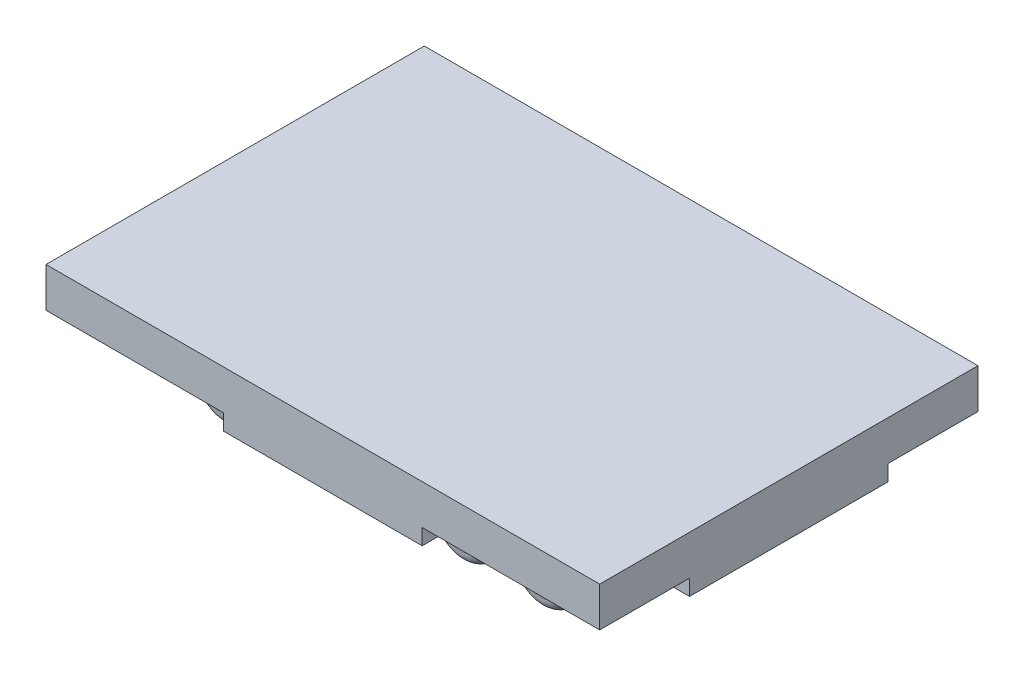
ISO-10303-21;
HEADER;
FILE_DESCRIPTION(('STEP AP214'),'2;1');
FILE_NAME('part.step','',(''),(''),'','','');
FILE_SCHEMA(('AUTOMOTIVE_DESIGN { 1 0 10303 214 1 1 1 1 }'));
ENDSEC;
DATA;
#1=APPLICATION_CONTEXT('core data for automotive mechanical design processes');
#2=APPLICATION_PROTOCOL_DEFINITION('international standard','automotive_design',2000,#1);
#3=PRODUCT_CONTEXT('',#1,'mechanical');
#4=PRODUCT('Part','Part','',(#3));
#5=PRODUCT_RELATED_PRODUCT_CATEGORY('part','',(#4));
#6=PRODUCT_DEFINITION_FORMATION('','',#4);
#7=PRODUCT_DEFINITION_CONTEXT('part definition',#1,'design');
#8=PRODUCT_DEFINITION('design','',#6,#7);
#9=PRODUCT_DEFINITION_SHAPE('','',#8);
#10=(LENGTH_UNIT() NAMED_UNIT(*) SI_UNIT(.MILLI.,.METRE.));
#11=(NAMED_UNIT(*) PLANE_ANGLE_UNIT() SI_UNIT($,.RADIAN.));
#12=(NAMED_UNIT(*) SI_UNIT($,.STERADIAN.) SOLID_ANGLE_UNIT());
#13=UNCERTAINTY_MEASURE_WITH_UNIT(LENGTH_MEASURE(1.E-05),#10,'distance_accuracy_value','');
#14=(GEOMETRIC_REPRESENTATION_CONTEXT(3) GLOBAL_UNCERTAINTY_ASSIGNED_CONTEXT((#13)) GLOBAL_UNIT_ASSIGNED_CONTEXT((#10,
#11,#12)) REPRESENTATION_CONTEXT('',''));
#15=CARTESIAN_POINT('',(0.,0.,0.));
#16=DIRECTION('',(0.,0.,1.));
#17=DIRECTION('',(1.,0.,0.));
#18=AXIS2_PLACEMENT_3D('',#15,#16,#17);
#19=CARTESIAN_POINT('',(-34.8431512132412,25.,-23.8064462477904));
#20=DIRECTION('',(-1.,0.,0.));
#21=DIRECTION('',(0.,0.,1.));
#22=AXIS2_PLACEMENT_3D('',#19,#20,#21);
#23=PLANE('',#22);
#24=DIRECTION('',(0.,-1.,0.));
#25=VECTOR('',#24,1.);
#26=CARTESIAN_POINT('',(-34.8431512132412,25.,12.5));
#27=LINE('',#26,#25);
#28=CARTESIAN_POINT('',(-34.8431512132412,20.,12.5));
#29=VERTEX_POINT('',#28);
#30=CARTESIAN_POINT('',(-34.8431512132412,18.,12.5));
#31=VERTEX_POINT('',#30);
#32=EDGE_CURVE('E777',#29,#31,#27,.T.);
#33=ORIENTED_EDGE('',*,*,#32,.F.);
#34=DIRECTION('',(0.,0.,1.));
#35=VECTOR('',#34,1.);
#36=CARTESIAN_POINT('',(-34.8431512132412,20.,-23.8064462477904));
#37=LINE('',#36,#35);
#38=CARTESIAN_POINT('',(-34.8431512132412,20.,23.8064462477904));
#39=VERTEX_POINT('',#38);
#40=EDGE_CURVE('E773',#29,#39,#37,.T.);
#41=ORIENTED_EDGE('',*,*,#40,.T.);
#42=DIRECTION('',(0.,-1.,0.));
#43=VECTOR('',#42,1.);
#44=CARTESIAN_POINT('',(-34.8431512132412,25.,23.8064462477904));
#45=LINE('',#44,#43);
#46=CARTESIAN_POINT('',(-34.8431512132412,25.,23.8064462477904));
#47=VERTEX_POINT('',#46);
#48=EDGE_CURVE('E807',#47,#39,#45,.T.);
#49=ORIENTED_EDGE('',*,*,#48,.F.);
#50=DIRECTION('',(0.,0.,-1.));
#51=VECTOR('',#50,1.);
#52=CARTESIAN_POINT('',(-34.8431512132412,25.,-23.8064462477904));
#53=LINE('',#52,#51);
#54=CARTESIAN_POINT('',(-34.8431512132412,25.,-23.8064462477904));
#55=VERTEX_POINT('',#54);
#56=EDGE_CURVE('E793',#47,#55,#53,.T.);
#57=ORIENTED_EDGE('',*,*,#56,.T.);
#58=DIRECTION('',(0.,-1.,0.));
#59=VECTOR('',#58,1.);
#60=CARTESIAN_POINT('',(-34.8431512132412,25.,-23.8064462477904));
#61=LINE('',#60,#59);
#62=CARTESIAN_POINT('',(-34.8431512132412,20.,-23.8064462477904));
#63=VERTEX_POINT('',#62);
#64=EDGE_CURVE('E804',#55,#63,#61,.T.);
#65=ORIENTED_EDGE('',*,*,#64,.T.);
#66=DIRECTION('',(0.,0.,-1.));
#67=VECTOR('',#66,1.);
#68=CARTESIAN_POINT('',(-34.8431512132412,20.,-23.8064462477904));
#69=LINE('',#68,#67);
#70=CARTESIAN_POINT('',(-34.8431512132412,20.,-12.5));
#71=VERTEX_POINT('',#70);
#72=EDGE_CURVE('E823',#71,#63,#69,.T.);
#73=ORIENTED_EDGE('',*,*,#72,.F.);
#74=DIRECTION('',(0.,1.,0.));
#75=VECTOR('',#74,1.);
#76=CARTESIAN_POINT('',(-34.8431512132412,25.,-12.5));
#77=LINE('',#76,#75);
#78=CARTESIAN_POINT('',(-34.8431512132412,18.,-12.5));
#79=VERTEX_POINT('',#78);
#80=EDGE_CURVE('E825',#79,#71,#77,.T.);
#81=ORIENTED_EDGE('',*,*,#80,.F.);
#82=DIRECTION('',(0.,0.,-1.));
#83=VECTOR('',#82,1.);
#84=CARTESIAN_POINT('',(-34.8431512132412,18.,-23.8064462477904));
#85=LINE('',#84,#83);
#86=EDGE_CURVE('E827',#31,#79,#85,.T.);
#87=ORIENTED_EDGE('',*,*,#86,.F.);
#88=EDGE_LOOP('',(#33,#41,#49,#57,#65,#73,#81,#87));
#89=FACE_BOUND('',#88,.T.);
#90=ADVANCED_FACE('F36',(#89),#23,.T.);
#91=CARTESIAN_POINT('',(-34.8431512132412,25.,23.8064462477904));
#92=DIRECTION('',(0.,0.,1.));
#93=DIRECTION('',(1.,0.,0.));
#94=AXIS2_PLACEMENT_3D('',#91,#92,#93);
#95=PLANE('',#94);
#96=ORIENTED_EDGE('',*,*,#48,.T.);
#97=DIRECTION('',(1.,0.,0.));
#98=VECTOR('',#97,1.);
#99=CARTESIAN_POINT('',(-34.8431512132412,20.,23.8064462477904));
#100=LINE('',#99,#98);
#101=CARTESIAN_POINT('',(-12.5,20.,23.8064462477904));
#102=VERTEX_POINT('',#101);
#103=EDGE_CURVE('E820',#39,#102,#100,.T.);
#104=ORIENTED_EDGE('',*,*,#103,.T.);
#105=DIRECTION('',(0.,-1.,0.));
#106=VECTOR('',#105,1.);
#107=CARTESIAN_POINT('',(-12.5,25.,23.8064462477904));
#108=LINE('',#107,#106);
#109=CARTESIAN_POINT('',(-12.5,18.,23.8064462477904));
#110=VERTEX_POINT('',#109);
#111=EDGE_CURVE('E818',#102,#110,#108,.T.);
#112=ORIENTED_EDGE('',*,*,#111,.T.);
#113=DIRECTION('',(1.,0.,0.));
#114=VECTOR('',#113,1.);
#115=CARTESIAN_POINT('',(-34.8431512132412,18.,23.8064462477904));
#116=LINE('',#115,#114);
#117=CARTESIAN_POINT('',(12.5,18.,23.8064462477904));
#118=VERTEX_POINT('',#117);
#119=EDGE_CURVE('E815',#110,#118,#116,.T.);
#120=ORIENTED_EDGE('',*,*,#119,.T.);
#121=DIRECTION('',(0.,1.,0.));
#122=VECTOR('',#121,1.);
#123=CARTESIAN_POINT('',(12.5,25.,23.8064462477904));
#124=LINE('',#123,#122);
#125=CARTESIAN_POINT('',(12.5,20.,23.8064462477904));
#126=VERTEX_POINT('',#125);
#127=EDGE_CURVE('E803',#118,#126,#124,.T.);
#128=ORIENTED_EDGE('',*,*,#127,.T.);
#129=DIRECTION('',(-1.,0.,0.));
#130=VECTOR('',#129,1.);
#131=CARTESIAN_POINT('',(-34.8431512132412,20.,23.8064462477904));
#132=LINE('',#131,#130);
#133=CARTESIAN_POINT('',(34.8431512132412,20.,23.8064462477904));
#134=VERTEX_POINT('',#133);
#135=EDGE_CURVE('E812',#134,#126,#132,.T.);
#136=ORIENTED_EDGE('',*,*,#135,.F.);
#137=DIRECTION('',(0.,-1.,0.));
#138=VECTOR('',#137,1.);
#139=CARTESIAN_POINT('',(34.8431512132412,25.,23.8064462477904));
#140=LINE('',#139,#138);
#141=CARTESIAN_POINT('',(34.8431512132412,25.,23.8064462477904));
#142=VERTEX_POINT('',#141);
#143=EDGE_CURVE('E799',#142,#134,#140,.T.);
#144=ORIENTED_EDGE('',*,*,#143,.F.);
#145=DIRECTION('',(-1.,0.,0.));
#146=VECTOR('',#145,1.);
#147=CARTESIAN_POINT('',(-34.8431512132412,25.,23.8064462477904));
#148=LINE('',#147,#146);
#149=EDGE_CURVE('E790',#142,#47,#148,.T.);
#150=ORIENTED_EDGE('',*,*,#149,.T.);
#151=EDGE_LOOP('',(#96,#104,#112,#120,#128,#136,#144,#150));
#152=FACE_BOUND('',#151,.T.);
#153=ADVANCED_FACE('F856',(#152),#95,.T.);
#154=CARTESIAN_POINT('',(34.8431512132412,25.,-23.8064462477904));
#155=DIRECTION('',(1.,0.,0.));
#156=DIRECTION('',(0.,0.,-1.));
#157=AXIS2_PLACEMENT_3D('',#154,#155,#156);
#158=PLANE('',#157);
#159=DIRECTION('',(0.,0.,1.));
#160=VECTOR('',#159,1.);
#161=CARTESIAN_POINT('',(34.8431512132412,20.,-23.8064462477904));
#162=LINE('',#161,#160);
#163=CARTESIAN_POINT('',(34.8431512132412,20.,12.5));
#164=VERTEX_POINT('',#163);
#165=EDGE_CURVE('E771',#164,#134,#162,.T.);
#166=ORIENTED_EDGE('',*,*,#165,.F.);
#167=DIRECTION('',(0.,-1.,0.));
#168=VECTOR('',#167,1.);
#169=CARTESIAN_POINT('',(34.8431512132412,25.,12.5));
#170=LINE('',#169,#168);
#171=CARTESIAN_POINT('',(34.8431512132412,18.,12.5));
#172=VERTEX_POINT('',#171);
#173=EDGE_CURVE('E40',#164,#172,#170,.T.);
#174=ORIENTED_EDGE('',*,*,#173,.T.);
#175=DIRECTION('',(0.,0.,-1.));
#176=VECTOR('',#175,1.);
#177=CARTESIAN_POINT('',(34.8431512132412,18.,-23.8064462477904));
#178=LINE('',#177,#176);
#179=CARTESIAN_POINT('',(34.8431512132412,18.,-12.5));
#180=VERTEX_POINT('',#179);
#181=EDGE_CURVE('E838',#172,#180,#178,.T.);
#182=ORIENTED_EDGE('',*,*,#181,.T.);
#183=DIRECTION('',(0.,1.,0.));
#184=VECTOR('',#183,1.);
#185=CARTESIAN_POINT('',(34.8431512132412,25.,-12.5));
#186=LINE('',#185,#184);
#187=CARTESIAN_POINT('',(34.8431512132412,20.,-12.5));
#188=VERTEX_POINT('',#187);
#189=EDGE_CURVE('E786',#180,#188,#186,.T.);
#190=ORIENTED_EDGE('',*,*,#189,.T.);
#191=DIRECTION('',(0.,0.,-1.));
#192=VECTOR('',#191,1.);
#193=CARTESIAN_POINT('',(34.8431512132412,20.,-23.8064462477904));
#194=LINE('',#193,#192);
#195=CARTESIAN_POINT('',(34.8431512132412,20.,-23.8064462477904));
#196=VERTEX_POINT('',#195);
#197=EDGE_CURVE('E782',#188,#196,#194,.T.);
#198=ORIENTED_EDGE('',*,*,#197,.T.);
#199=DIRECTION('',(0.,-1.,0.));
#200=VECTOR('',#199,1.);
#201=CARTESIAN_POINT('',(34.8431512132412,25.,-23.8064462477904));
#202=LINE('',#201,#200);
#203=CARTESIAN_POINT('',(34.8431512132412,25.,-23.8064462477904));
#204=VERTEX_POINT('',#203);
#205=EDGE_CURVE('E800',#204,#196,#202,.T.);
#206=ORIENTED_EDGE('',*,*,#205,.F.);
#207=DIRECTION('',(0.,0.,1.));
#208=VECTOR('',#207,1.);
#209=CARTESIAN_POINT('',(34.8431512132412,25.,-23.8064462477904));
#210=LINE('',#209,#208);
#211=EDGE_CURVE('E787',#204,#142,#210,.T.);
#212=ORIENTED_EDGE('',*,*,#211,.T.);
#213=ORIENTED_EDGE('',*,*,#143,.T.);
#214=EDGE_LOOP('',(#166,#174,#182,#190,#198,#206,#212,#213));
#215=FACE_BOUND('',#214,.T.);
#216=ADVANCED_FACE('F38',(#215),#158,.T.);
#217=CARTESIAN_POINT('',(-34.8431512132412,25.,-23.8064462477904));
#218=DIRECTION('',(0.,0.,-1.));
#219=DIRECTION('',(-1.,0.,0.));
#220=AXIS2_PLACEMENT_3D('',#217,#218,#219);
#221=PLANE('',#220);
#222=DIRECTION('',(1.,0.,0.));
#223=VECTOR('',#222,1.);
#224=CARTESIAN_POINT('',(-34.8431512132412,20.,-23.8064462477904));
#225=LINE('',#224,#223);
#226=CARTESIAN_POINT('',(-12.5,20.,-23.8064462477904));
#227=VERTEX_POINT('',#226);
#228=EDGE_CURVE('E780',#63,#227,#225,.T.);
#229=ORIENTED_EDGE('',*,*,#228,.F.);
#230=ORIENTED_EDGE('',*,*,#64,.F.);
#231=DIRECTION('',(1.,0.,0.));
#232=VECTOR('',#231,1.);
#233=CARTESIAN_POINT('',(-34.8431512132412,25.,-23.8064462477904));
#234=LINE('',#233,#232);
#235=EDGE_CURVE('E796',#55,#204,#234,.T.);
#236=ORIENTED_EDGE('',*,*,#235,.T.);
#237=ORIENTED_EDGE('',*,*,#205,.T.);
#238=DIRECTION('',(-1.,0.,0.));
#239=VECTOR('',#238,1.);
#240=CARTESIAN_POINT('',(-34.8431512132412,20.,-23.8064462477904));
#241=LINE('',#240,#239);
#242=CARTESIAN_POINT('',(12.5,20.,-23.8064462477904));
#243=VERTEX_POINT('',#242);
#244=EDGE_CURVE('E776',#196,#243,#241,.T.);
#245=ORIENTED_EDGE('',*,*,#244,.T.);
#246=DIRECTION('',(0.,1.,0.));
#247=VECTOR('',#246,1.);
#248=CARTESIAN_POINT('',(12.5,25.,-23.8064462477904));
#249=LINE('',#248,#247);
#250=CARTESIAN_POINT('',(12.5,18.,-23.8064462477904));
#251=VERTEX_POINT('',#250);
#252=EDGE_CURVE('E832',#251,#243,#249,.T.);
#253=ORIENTED_EDGE('',*,*,#252,.F.);
#254=DIRECTION('',(1.,0.,0.));
#255=VECTOR('',#254,1.);
#256=CARTESIAN_POINT('',(-34.8431512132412,18.,-23.8064462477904));
#257=LINE('',#256,#255);
#258=CARTESIAN_POINT('',(-12.5,18.,-23.8064462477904));
#259=VERTEX_POINT('',#258);
#260=EDGE_CURVE('E834',#259,#251,#257,.T.);
#261=ORIENTED_EDGE('',*,*,#260,.F.);
#262=DIRECTION('',(0.,-1.,0.));
#263=VECTOR('',#262,1.);
#264=CARTESIAN_POINT('',(-12.5,25.,-23.8064462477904));
#265=LINE('',#264,#263);
#266=EDGE_CURVE('E783',#227,#259,#265,.T.);
#267=ORIENTED_EDGE('',*,*,#266,.F.);
#268=EDGE_LOOP('',(#229,#230,#236,#237,#245,#253,#261,#267));
#269=FACE_BOUND('',#268,.T.);
#270=ADVANCED_FACE('F1143',(#269),#221,.T.);
#271=CARTESIAN_POINT('',(0.,25.,0.));
#272=DIRECTION('',(0.,1.,0.));
#273=DIRECTION('',(0.,0.,1.));
#274=AXIS2_PLACEMENT_3D('',#271,#272,#273);
#275=PLANE('',#274);
#276=ORIENTED_EDGE('',*,*,#211,.F.);
#277=ORIENTED_EDGE('',*,*,#235,.F.);
#278=ORIENTED_EDGE('',*,*,#56,.F.);
#279=ORIENTED_EDGE('',*,*,#149,.F.);
#280=EDGE_LOOP('',(#276,#277,#278,#279));
#281=FACE_BOUND('',#280,.T.);
#282=ADVANCED_FACE('F1140',(#281),#275,.T.);
#283=CARTESIAN_POINT('',(-22.5,15.,15.));
#284=DIRECTION('',(0.,-1.,0.));
#285=DIRECTION('',(0.,0.,-1.));
#286=AXIS2_PLACEMENT_3D('',#283,#284,#285);
#287=CYLINDRICAL_SURFACE('',#286,1.5);
#288=CARTESIAN_POINT('',(-22.5,20.,15.));
#289=DIRECTION('',(0.,-1.,0.));
#290=DIRECTION('',(1.,0.,0.));
#291=AXIS2_PLACEMENT_3D('',#288,#289,#290);
#292=CIRCLE('',#291,1.5);
#293=CARTESIAN_POINT('',(-24.,20.,15.));
#294=VERTEX_POINT('',#293);
#295=CARTESIAN_POINT('',(-22.5,20.,16.5));
#296=VERTEX_POINT('',#295);
#297=EDGE_CURVE('E736',#294,#296,#292,.F.);
#298=ORIENTED_EDGE('',*,*,#297,.F.);
#299=DIRECTION('',(0.,1.,0.));
#300=VECTOR('',#299,1.);
#301=CARTESIAN_POINT('',(-24.,20.,15.));
#302=LINE('',#301,#300);
#303=CARTESIAN_POINT('',(-24.,15.,15.));
#304=VERTEX_POINT('',#303);
#305=EDGE_CURVE('E1075',#304,#294,#302,.T.);
#306=ORIENTED_EDGE('',*,*,#305,.F.);
#307=CARTESIAN_POINT('',(-22.5,15.,15.));
#308=DIRECTION('',(0.,-1.,0.));
#309=DIRECTION('',(0.,0.,-1.));
#310=AXIS2_PLACEMENT_3D('',#307,#308,#309);
#311=CIRCLE('',#310,1.5);
#312=CARTESIAN_POINT('',(-22.5,15.,16.5));
#313=VERTEX_POINT('',#312);
#314=EDGE_CURVE('E1072',#304,#313,#311,.F.);
#315=ORIENTED_EDGE('',*,*,#314,.T.);
#316=DIRECTION('',(0.,1.,0.));
#317=VECTOR('',#316,1.);
#318=CARTESIAN_POINT('',(-22.5,15.,16.5));
#319=LINE('',#318,#317);
#320=EDGE_CURVE('E599',#296,#313,#319,.F.);
#321=ORIENTED_EDGE('',*,*,#320,.F.);
#322=EDGE_LOOP('',(#298,#306,#315,#321));
#323=FACE_BOUND('',#322,.T.);
#324=ADVANCED_FACE('F1377',(#323),#287,.T.);
#325=CARTESIAN_POINT('',(22.5,15.,15.));
#326=DIRECTION('',(0.,1.,0.));
#327=DIRECTION('',(0.,0.,1.));
#328=AXIS2_PLACEMENT_3D('',#325,#326,#327);
#329=CYLINDRICAL_SURFACE('',#328,1.5);
#330=CARTESIAN_POINT('',(22.5,20.,15.));
#331=DIRECTION('',(0.,-1.,0.));
#332=DIRECTION('',(1.,0.,0.));
#333=AXIS2_PLACEMENT_3D('',#330,#331,#332);
#334=CIRCLE('',#333,1.5);
#335=CARTESIAN_POINT('',(22.5,20.,16.5));
#336=VERTEX_POINT('',#335);
#337=CARTESIAN_POINT('',(24.,20.,15.));
#338=VERTEX_POINT('',#337);
#339=EDGE_CURVE('E408',#336,#338,#334,.F.);
#340=ORIENTED_EDGE('',*,*,#339,.F.);
#341=DIRECTION('',(0.,1.,0.));
#342=VECTOR('',#341,1.);
#343=CARTESIAN_POINT('',(22.5,15.,16.5));
#344=LINE('',#343,#342);
#345=CARTESIAN_POINT('',(22.5,15.,16.5));
#346=VERTEX_POINT('',#345);
#347=EDGE_CURVE('E416',#346,#336,#344,.T.);
#348=ORIENTED_EDGE('',*,*,#347,.F.);
#349=CARTESIAN_POINT('',(22.5,15.,15.));
#350=DIRECTION('',(0.,1.,0.));
#351=DIRECTION('',(-1.,0.,0.));
#352=AXIS2_PLACEMENT_3D('',#349,#350,#351);
#353=CIRCLE('',#352,1.5);
#354=CARTESIAN_POINT('',(24.,15.,15.));
#355=VERTEX_POINT('',#354);
#356=EDGE_CURVE('E407',#355,#346,#353,.F.);
#357=ORIENTED_EDGE('',*,*,#356,.F.);
#358=DIRECTION('',(0.,1.,0.));
#359=VECTOR('',#358,1.);
#360=CARTESIAN_POINT('',(24.,20.,15.));
#361=LINE('',#360,#359);
#362=EDGE_CURVE('E397',#338,#355,#361,.F.);
#363=ORIENTED_EDGE('',*,*,#362,.F.);
#364=EDGE_LOOP('',(#340,#348,#357,#363));
#365=FACE_BOUND('',#364,.T.);
#366=ADVANCED_FACE('F418',(#365),#329,.T.);
#367=CARTESIAN_POINT('',(20.,15.,15.));
#368=DIRECTION('',(0.,0.,-1.));
#369=DIRECTION('',(-1.,0.,0.));
#370=AXIS2_PLACEMENT_3D('',#367,#368,#369);
#371=TOROIDAL_SURFACE('',#370,2.5,1.5);
#372=ORIENTED_EDGE('',*,*,#356,.T.);
#373=CARTESIAN_POINT('',(20.,15.,16.5));
#374=DIRECTION('',(0.,0.,-1.));
#375=DIRECTION('',(-1.,0.,0.));
#376=AXIS2_PLACEMENT_3D('',#373,#374,#375);
#377=CIRCLE('',#376,2.5);
#378=CARTESIAN_POINT('',(18.0769230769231,13.4025723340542,16.5));
#379=VERTEX_POINT('',#378);
#380=EDGE_CURVE('E1021',#379,#346,#377,.F.);
#381=ORIENTED_EDGE('',*,*,#380,.F.);
#382=CARTESIAN_POINT('',(18.0769230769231,13.4025723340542,15.));
#383=DIRECTION('',(-0.638971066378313,0.76923076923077,0.));
#384=DIRECTION('',(-0.76923076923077,-0.638971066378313,0.));
#385=AXIS2_PLACEMENT_3D('',#382,#383,#384);
#386=CIRCLE('',#385,1.5);
#387=CARTESIAN_POINT('',(16.9230769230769,12.4441157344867,15.));
#388=VERTEX_POINT('',#387);
#389=EDGE_CURVE('E415',#388,#379,#386,.T.);
#390=ORIENTED_EDGE('',*,*,#389,.F.);
#391=CARTESIAN_POINT('',(20.,15.,15.));
#392=DIRECTION('',(0.,0.,-1.));
#393=DIRECTION('',(-1.,0.,0.));
#394=AXIS2_PLACEMENT_3D('',#391,#392,#393);
#395=CIRCLE('',#394,4.);
#396=EDGE_CURVE('E387',#355,#388,#395,.T.);
#397=ORIENTED_EDGE('',*,*,#396,.F.);
#398=EDGE_LOOP('',(#372,#381,#390,#397));
#399=FACE_BOUND('',#398,.T.);
#400=ADVANCED_FACE('F413',(#399),#371,.T.);
#401=CARTESIAN_POINT('',(15.,10.846688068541,15.));
#402=DIRECTION('',(0.,0.,-1.));
#403=DIRECTION('',(-1.,0.,0.));
#404=AXIS2_PLACEMENT_3D('',#401,#402,#403);
#405=TOROIDAL_SURFACE('',#404,4.,1.5);
#406=ORIENTED_EDGE('',*,*,#389,.T.);
#407=CARTESIAN_POINT('',(15.,10.846688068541,16.5));
#408=DIRECTION('',(0.,0.,-1.));
#409=DIRECTION('',(-1.,0.,0.));
#410=AXIS2_PLACEMENT_3D('',#407,#408,#409);
#411=CIRCLE('',#410,4.);
#412=CARTESIAN_POINT('',(11.9230769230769,13.4025723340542,16.5));
#413=VERTEX_POINT('',#412);
#414=EDGE_CURVE('E1028',#413,#379,#411,.T.);
#415=ORIENTED_EDGE('',*,*,#414,.F.);
#416=CARTESIAN_POINT('',(11.9230769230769,13.4025723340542,15.));
#417=DIRECTION('',(0.638971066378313,0.76923076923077,0.));
#418=DIRECTION('',(-0.76923076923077,0.638971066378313,0.));
#419=AXIS2_PLACEMENT_3D('',#416,#417,#418);
#420=CIRCLE('',#419,1.5);
#421=CARTESIAN_POINT('',(13.0769230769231,12.4441157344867,15.));
#422=VERTEX_POINT('',#421);
#423=EDGE_CURVE('E1020',#422,#413,#420,.F.);
#424=ORIENTED_EDGE('',*,*,#423,.F.);
#425=CARTESIAN_POINT('',(15.,10.846688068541,15.));
#426=DIRECTION('',(0.,0.,-1.));
#427=DIRECTION('',(-1.,0.,0.));
#428=AXIS2_PLACEMENT_3D('',#425,#426,#427);
#429=CIRCLE('',#428,2.5);
#430=EDGE_CURVE('E1017',#388,#422,#429,.F.);
#431=ORIENTED_EDGE('',*,*,#430,.F.);
#432=EDGE_LOOP('',(#406,#415,#424,#431));
#433=FACE_BOUND('',#432,.T.);
#434=ADVANCED_FACE('F1575',(#433),#405,.T.);
#435=CARTESIAN_POINT('',(10.,15.,15.));
#436=DIRECTION('',(0.,0.,-1.));
#437=DIRECTION('',(-1.,0.,0.));
#438=AXIS2_PLACEMENT_3D('',#435,#436,#437);
#439=TOROIDAL_SURFACE('',#438,2.5,1.5);
#440=ORIENTED_EDGE('',*,*,#423,.T.);
#441=CARTESIAN_POINT('',(10.,15.,16.5));
#442=DIRECTION('',(0.,0.,-1.));
#443=DIRECTION('',(-1.,0.,0.));
#444=AXIS2_PLACEMENT_3D('',#441,#442,#443);
#445=CIRCLE('',#444,2.5);
#446=CARTESIAN_POINT('',(8.07692307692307,13.4025723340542,16.5));
#447=VERTEX_POINT('',#446);
#448=EDGE_CURVE('E1035',#447,#413,#445,.F.);
#449=ORIENTED_EDGE('',*,*,#448,.F.);
#450=CARTESIAN_POINT('',(8.07692307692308,13.4025723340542,15.));
#451=DIRECTION('',(-0.638971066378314,0.769230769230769,0.));
#452=DIRECTION('',(-0.769230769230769,-0.638971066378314,0.));
#453=AXIS2_PLACEMENT_3D('',#450,#451,#452);
#454=CIRCLE('',#453,1.5);
#455=CARTESIAN_POINT('',(6.92307692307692,12.4441157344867,15.));
#456=VERTEX_POINT('',#455);
#457=EDGE_CURVE('E1027',#456,#447,#454,.T.);
#458=ORIENTED_EDGE('',*,*,#457,.F.);
#459=CARTESIAN_POINT('',(10.,15.,15.));
#460=DIRECTION('',(0.,0.,-1.));
#461=DIRECTION('',(-1.,0.,0.));
#462=AXIS2_PLACEMENT_3D('',#459,#460,#461);
#463=CIRCLE('',#462,4.);
#464=EDGE_CURVE('E1024',#422,#456,#463,.T.);
#465=ORIENTED_EDGE('',*,*,#464,.F.);
#466=EDGE_LOOP('',(#440,#449,#458,#465));
#467=FACE_BOUND('',#466,.T.);
#468=ADVANCED_FACE('F1586',(#467),#439,.T.);
#469=CARTESIAN_POINT('',(5.,10.846688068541,15.));
#470=DIRECTION('',(0.,0.,-1.));
#471=DIRECTION('',(-1.,0.,0.));
#472=AXIS2_PLACEMENT_3D('',#469,#470,#471);
#473=TOROIDAL_SURFACE('',#472,4.,1.5);
#474=ORIENTED_EDGE('',*,*,#457,.T.);
#475=CARTESIAN_POINT('',(5.,10.846688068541,16.5));
#476=DIRECTION('',(0.,0.,-1.));
#477=DIRECTION('',(-1.,0.,0.));
#478=AXIS2_PLACEMENT_3D('',#475,#476,#477);
#479=CIRCLE('',#478,4.);
#480=CARTESIAN_POINT('',(1.92307692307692,13.4025723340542,16.5));
#481=VERTEX_POINT('',#480);
#482=EDGE_CURVE('E1042',#481,#447,#479,.T.);
#483=ORIENTED_EDGE('',*,*,#482,.F.);
#484=CARTESIAN_POINT('',(1.92307692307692,13.4025723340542,15.));
#485=DIRECTION('',(0.638971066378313,0.769230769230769,0.));
#486=DIRECTION('',(-0.769230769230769,0.638971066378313,0.));
#487=AXIS2_PLACEMENT_3D('',#484,#485,#486);
#488=CIRCLE('',#487,1.5);
#489=CARTESIAN_POINT('',(3.07692307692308,12.4441157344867,15.));
#490=VERTEX_POINT('',#489);
#491=EDGE_CURVE('E1034',#490,#481,#488,.F.);
#492=ORIENTED_EDGE('',*,*,#491,.F.);
#493=CARTESIAN_POINT('',(5.,10.846688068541,15.));
#494=DIRECTION('',(0.,0.,-1.));
#495=DIRECTION('',(-1.,0.,0.));
#496=AXIS2_PLACEMENT_3D('',#493,#494,#495);
#497=CIRCLE('',#496,2.5);
#498=EDGE_CURVE('E1031',#456,#490,#497,.F.);
#499=ORIENTED_EDGE('',*,*,#498,.F.);
#500=EDGE_LOOP('',(#474,#483,#492,#499));
#501=FACE_BOUND('',#500,.T.);
#502=ADVANCED_FACE('F1598',(#501),#473,.T.);
#503=CARTESIAN_POINT('',(0.,15.,15.));
#504=DIRECTION('',(0.,0.,-1.));
#505=DIRECTION('',(-1.,0.,0.));
#506=AXIS2_PLACEMENT_3D('',#503,#504,#505);
#507=TOROIDAL_SURFACE('',#506,2.5,1.5);
#508=ORIENTED_EDGE('',*,*,#491,.T.);
#509=CARTESIAN_POINT('',(0.,15.,16.5));
#510=DIRECTION('',(0.,0.,-1.));
#511=DIRECTION('',(-1.,0.,0.));
#512=AXIS2_PLACEMENT_3D('',#509,#510,#511);
#513=CIRCLE('',#512,2.5);
#514=CARTESIAN_POINT('',(-1.92307692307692,13.4025723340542,16.5));
#515=VERTEX_POINT('',#514);
#516=EDGE_CURVE('E1049',#515,#481,#513,.F.);
#517=ORIENTED_EDGE('',*,*,#516,.F.);
#518=CARTESIAN_POINT('',(-1.92307692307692,13.4025723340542,15.));
#519=DIRECTION('',(-0.638971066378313,0.76923076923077,0.));
#520=DIRECTION('',(-0.76923076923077,-0.638971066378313,0.));
#521=AXIS2_PLACEMENT_3D('',#518,#519,#520);
#522=CIRCLE('',#521,1.5);
#523=CARTESIAN_POINT('',(-3.07692307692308,12.4441157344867,15.));
#524=VERTEX_POINT('',#523);
#525=EDGE_CURVE('E1041',#524,#515,#522,.T.);
#526=ORIENTED_EDGE('',*,*,#525,.F.);
#527=CARTESIAN_POINT('',(0.,15.,15.));
#528=DIRECTION('',(0.,0.,-1.));
#529=DIRECTION('',(-1.,0.,0.));
#530=AXIS2_PLACEMENT_3D('',#527,#528,#529);
#531=CIRCLE('',#530,4.);
#532=EDGE_CURVE('E1038',#490,#524,#531,.T.);
#533=ORIENTED_EDGE('',*,*,#532,.F.);
#534=EDGE_LOOP('',(#508,#517,#526,#533));
#535=FACE_BOUND('',#534,.T.);
#536=ADVANCED_FACE('F1609',(#535),#507,.T.);
#537=CARTESIAN_POINT('',(-5.,10.846688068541,15.));
#538=DIRECTION('',(0.,0.,-1.));
#539=DIRECTION('',(-1.,0.,0.));
#540=AXIS2_PLACEMENT_3D('',#537,#538,#539);
#541=TOROIDAL_SURFACE('',#540,4.,1.5);
#542=ORIENTED_EDGE('',*,*,#525,.T.);
#543=CARTESIAN_POINT('',(-5.,10.846688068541,16.5));
#544=DIRECTION('',(0.,0.,-1.));
#545=DIRECTION('',(-1.,0.,0.));
#546=AXIS2_PLACEMENT_3D('',#543,#544,#545);
#547=CIRCLE('',#546,4.);
#548=CARTESIAN_POINT('',(-8.07692307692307,13.4025723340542,16.5));
#549=VERTEX_POINT('',#548);
#550=EDGE_CURVE('E1056',#549,#515,#547,.T.);
#551=ORIENTED_EDGE('',*,*,#550,.F.);
#552=CARTESIAN_POINT('',(-8.07692307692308,13.4025723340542,15.));
#553=DIRECTION('',(0.638971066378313,0.76923076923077,0.));
#554=DIRECTION('',(-0.76923076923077,0.638971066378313,0.));
#555=AXIS2_PLACEMENT_3D('',#552,#553,#554);
#556=CIRCLE('',#555,1.5);
#557=CARTESIAN_POINT('',(-6.92307692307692,12.4441157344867,15.));
#558=VERTEX_POINT('',#557);
#559=EDGE_CURVE('E1048',#558,#549,#556,.F.);
#560=ORIENTED_EDGE('',*,*,#559,.F.);
#561=CARTESIAN_POINT('',(-5.,10.846688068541,15.));
#562=DIRECTION('',(0.,0.,-1.));
#563=DIRECTION('',(-1.,0.,0.));
#564=AXIS2_PLACEMENT_3D('',#561,#562,#563);
#565=CIRCLE('',#564,2.5);
#566=EDGE_CURVE('E1045',#524,#558,#565,.F.);
#567=ORIENTED_EDGE('',*,*,#566,.F.);
#568=EDGE_LOOP('',(#542,#551,#560,#567));
#569=FACE_BOUND('',#568,.T.);
#570=ADVANCED_FACE('F1621',(#569),#541,.T.);
#571=CARTESIAN_POINT('',(-10.,15.,15.));
#572=DIRECTION('',(0.,0.,-1.));
#573=DIRECTION('',(-1.,0.,0.));
#574=AXIS2_PLACEMENT_3D('',#571,#572,#573);
#575=TOROIDAL_SURFACE('',#574,2.5,1.5);
#576=ORIENTED_EDGE('',*,*,#559,.T.);
#577=CARTESIAN_POINT('',(-10.,15.,16.5));
#578=DIRECTION('',(0.,0.,-1.));
#579=DIRECTION('',(-1.,0.,0.));
#580=AXIS2_PLACEMENT_3D('',#577,#578,#579);
#581=CIRCLE('',#580,2.5);
#582=CARTESIAN_POINT('',(-11.9230769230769,13.4025723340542,16.5));
#583=VERTEX_POINT('',#582);
#584=EDGE_CURVE('E1064',#583,#549,#581,.F.);
#585=ORIENTED_EDGE('',*,*,#584,.F.);
#586=CARTESIAN_POINT('',(-11.9230769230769,13.4025723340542,15.));
#587=DIRECTION('',(-0.638971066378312,0.76923076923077,0.));
#588=DIRECTION('',(-0.76923076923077,-0.638971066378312,0.));
#589=AXIS2_PLACEMENT_3D('',#586,#587,#588);
#590=CIRCLE('',#589,1.5);
#591=CARTESIAN_POINT('',(-13.0769230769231,12.4441157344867,15.));
#592=VERTEX_POINT('',#591);
#593=EDGE_CURVE('E1055',#592,#583,#590,.T.);
#594=ORIENTED_EDGE('',*,*,#593,.F.);
#595=CARTESIAN_POINT('',(-10.,15.,15.));
#596=DIRECTION('',(0.,0.,-1.));
#597=DIRECTION('',(-1.,0.,0.));
#598=AXIS2_PLACEMENT_3D('',#595,#596,#597);
#599=CIRCLE('',#598,4.);
#600=EDGE_CURVE('E1052',#558,#592,#599,.T.);
#601=ORIENTED_EDGE('',*,*,#600,.F.);
#602=EDGE_LOOP('',(#576,#585,#594,#601));
#603=FACE_BOUND('',#602,.T.);
#604=ADVANCED_FACE('F1633',(#603),#575,.T.);
#605=CARTESIAN_POINT('',(-15.,10.846688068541,15.));
#606=DIRECTION('',(0.,0.,-1.));
#607=DIRECTION('',(-1.,0.,0.));
#608=AXIS2_PLACEMENT_3D('',#605,#606,#607);
#609=TOROIDAL_SURFACE('',#608,4.,1.5);
#610=ORIENTED_EDGE('',*,*,#593,.T.);
#611=CARTESIAN_POINT('',(-15.,10.846688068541,16.5));
#612=DIRECTION('',(0.,0.,-1.));
#613=DIRECTION('',(-1.,0.,0.));
#614=AXIS2_PLACEMENT_3D('',#611,#612,#613);
#615=CIRCLE('',#614,4.);
#616=CARTESIAN_POINT('',(-18.0769230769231,13.4025723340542,16.5));
#617=VERTEX_POINT('',#616);
#618=EDGE_CURVE('E1069',#617,#583,#615,.T.);
#619=ORIENTED_EDGE('',*,*,#618,.F.);
#620=CARTESIAN_POINT('',(-18.0769230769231,13.4025723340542,15.));
#621=DIRECTION('',(0.638971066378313,0.769230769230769,0.));
#622=DIRECTION('',(-0.769230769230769,0.638971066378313,0.));
#623=AXIS2_PLACEMENT_3D('',#620,#621,#622);
#624=CIRCLE('',#623,1.5);
#625=CARTESIAN_POINT('',(-16.9230769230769,12.4441157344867,15.));
#626=VERTEX_POINT('',#625);
#627=EDGE_CURVE('E1063',#626,#617,#624,.F.);
#628=ORIENTED_EDGE('',*,*,#627,.F.);
#629=CARTESIAN_POINT('',(-15.,10.846688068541,15.));
#630=DIRECTION('',(0.,0.,-1.));
#631=DIRECTION('',(-1.,0.,0.));
#632=AXIS2_PLACEMENT_3D('',#629,#630,#631);
#633=CIRCLE('',#632,2.5);
#634=EDGE_CURVE('E1060',#592,#626,#633,.F.);
#635=ORIENTED_EDGE('',*,*,#634,.F.);
#636=EDGE_LOOP('',(#610,#619,#628,#635));
#637=FACE_BOUND('',#636,.T.);
#638=ADVANCED_FACE('F1645',(#637),#609,.T.);
#639=CARTESIAN_POINT('',(-20.,15.,15.));
#640=DIRECTION('',(0.,0.,-1.));
#641=DIRECTION('',(-1.,0.,0.));
#642=AXIS2_PLACEMENT_3D('',#639,#640,#641);
#643=TOROIDAL_SURFACE('',#642,2.5,1.5);
#644=ORIENTED_EDGE('',*,*,#627,.T.);
#645=CARTESIAN_POINT('',(-20.,15.,16.5));
#646=DIRECTION('',(0.,0.,-1.));
#647=DIRECTION('',(-1.,0.,0.));
#648=AXIS2_PLACEMENT_3D('',#645,#646,#647);
#649=CIRCLE('',#648,2.5);
#650=EDGE_CURVE('E1068',#313,#617,#649,.F.);
#651=ORIENTED_EDGE('',*,*,#650,.F.);
#652=ORIENTED_EDGE('',*,*,#314,.F.);
#653=CARTESIAN_POINT('',(-20.,15.,15.));
#654=DIRECTION('',(0.,0.,-1.));
#655=DIRECTION('',(-1.,0.,0.));
#656=AXIS2_PLACEMENT_3D('',#653,#654,#655);
#657=CIRCLE('',#656,4.);
#658=EDGE_CURVE('E1065',#626,#304,#657,.T.);
#659=ORIENTED_EDGE('',*,*,#658,.F.);
#660=EDGE_LOOP('',(#644,#651,#652,#659));
#661=FACE_BOUND('',#660,.T.);
#662=ADVANCED_FACE('F1657',(#661),#643,.T.);
#663=CARTESIAN_POINT('',(-20.,15.,17.5));
#664=DIRECTION('',(0.,0.,-1.));
#665=DIRECTION('',(-1.,0.,0.));
#666=AXIS2_PLACEMENT_3D('',#663,#664,#665);
#667=CYLINDRICAL_SURFACE('',#666,4.);
#668=DIRECTION('',(0.,0.,-1.));
#669=VECTOR('',#668,1.);
#670=CARTESIAN_POINT('',(-24.,15.,17.5));
#671=LINE('',#670,#669);
#672=CARTESIAN_POINT('',(-24.,15.,-15.));
#673=VERTEX_POINT('',#672);
#674=EDGE_CURVE('E1059',#304,#673,#671,.T.);
#675=ORIENTED_EDGE('',*,*,#674,.T.);
#676=CARTESIAN_POINT('',(-20.,15.,-15.));
#677=DIRECTION('',(0.,0.,-1.));
#678=DIRECTION('',(-1.,0.,0.));
#679=AXIS2_PLACEMENT_3D('',#676,#677,#678);
#680=CIRCLE('',#679,4.);
#681=CARTESIAN_POINT('',(-16.9230769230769,12.4441157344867,-15.));
#682=VERTEX_POINT('',#681);
#683=EDGE_CURVE('E974',#673,#682,#680,.F.);
#684=ORIENTED_EDGE('',*,*,#683,.T.);
#685=DIRECTION('',(0.,0.,-1.));
#686=VECTOR('',#685,1.);
#687=CARTESIAN_POINT('',(-16.9230769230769,12.4441157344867,17.5));
#688=LINE('',#687,#686);
#689=EDGE_CURVE('E978',#626,#682,#688,.T.);
#690=ORIENTED_EDGE('',*,*,#689,.F.);
#691=ORIENTED_EDGE('',*,*,#658,.T.);
#692=EDGE_LOOP('',(#675,#684,#690,#691));
#693=FACE_BOUND('',#692,.T.);
#694=ADVANCED_FACE('F1669',(#693),#667,.T.);
#695=CARTESIAN_POINT('',(-15.,10.846688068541,17.5));
#696=DIRECTION('',(0.,0.,-1.));
#697=DIRECTION('',(-1.,0.,0.));
#698=AXIS2_PLACEMENT_3D('',#695,#696,#697);
#699=CYLINDRICAL_SURFACE('',#698,2.5);
#700=ORIENTED_EDGE('',*,*,#689,.T.);
#701=CARTESIAN_POINT('',(-15.,10.846688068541,-15.));
#702=DIRECTION('',(0.,0.,-1.));
#703=DIRECTION('',(-1.,0.,0.));
#704=AXIS2_PLACEMENT_3D('',#701,#702,#703);
#705=CIRCLE('',#704,2.5);
#706=CARTESIAN_POINT('',(-13.0769230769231,12.4441157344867,-15.));
#707=VERTEX_POINT('',#706);
#708=EDGE_CURVE('E980',#682,#707,#705,.T.);
#709=ORIENTED_EDGE('',*,*,#708,.T.);
#710=DIRECTION('',(0.,0.,-1.));
#711=VECTOR('',#710,1.);
#712=CARTESIAN_POINT('',(-13.0769230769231,12.4441157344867,17.5));
#713=LINE('',#712,#711);
#714=EDGE_CURVE('E977',#592,#707,#713,.T.);
#715=ORIENTED_EDGE('',*,*,#714,.F.);
#716=ORIENTED_EDGE('',*,*,#634,.T.);
#717=EDGE_LOOP('',(#700,#709,#715,#716));
#718=FACE_BOUND('',#717,.T.);
#719=ADVANCED_FACE('F1681',(#718),#699,.F.);
#720=CARTESIAN_POINT('',(-10.,15.,17.5));
#721=DIRECTION('',(0.,0.,-1.));
#722=DIRECTION('',(-1.,0.,0.));
#723=AXIS2_PLACEMENT_3D('',#720,#721,#722);
#724=CYLINDRICAL_SURFACE('',#723,4.);
#725=ORIENTED_EDGE('',*,*,#714,.T.);
#726=CARTESIAN_POINT('',(-10.,15.,-15.));
#727=DIRECTION('',(0.,0.,-1.));
#728=DIRECTION('',(-1.,0.,0.));
#729=AXIS2_PLACEMENT_3D('',#726,#727,#728);
#730=CIRCLE('',#729,4.);
#731=CARTESIAN_POINT('',(-6.92307692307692,12.4441157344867,-15.));
#732=VERTEX_POINT('',#731);
#733=EDGE_CURVE('E985',#707,#732,#730,.F.);
#734=ORIENTED_EDGE('',*,*,#733,.T.);
#735=DIRECTION('',(0.,0.,-1.));
#736=VECTOR('',#735,1.);
#737=CARTESIAN_POINT('',(-6.92307692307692,12.4441157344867,17.5));
#738=LINE('',#737,#736);
#739=EDGE_CURVE('E983',#558,#732,#738,.T.);
#740=ORIENTED_EDGE('',*,*,#739,.F.);
#741=ORIENTED_EDGE('',*,*,#600,.T.);
#742=EDGE_LOOP('',(#725,#734,#740,#741));
#743=FACE_BOUND('',#742,.T.);
#744=ADVANCED_FACE('F1692',(#743),#724,.T.);
#745=CARTESIAN_POINT('',(-5.,10.846688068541,17.5));
#746=DIRECTION('',(0.,0.,-1.));
#747=DIRECTION('',(-1.,0.,0.));
#748=AXIS2_PLACEMENT_3D('',#745,#746,#747);
#749=CYLINDRICAL_SURFACE('',#748,2.5);
#750=ORIENTED_EDGE('',*,*,#739,.T.);
#751=CARTESIAN_POINT('',(-5.,10.846688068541,-15.));
#752=DIRECTION('',(0.,0.,-1.));
#753=DIRECTION('',(-1.,0.,0.));
#754=AXIS2_PLACEMENT_3D('',#751,#752,#753);
#755=CIRCLE('',#754,2.5);
#756=CARTESIAN_POINT('',(-3.07692307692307,12.4441157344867,-15.));
#757=VERTEX_POINT('',#756);
#758=EDGE_CURVE('E990',#732,#757,#755,.T.);
#759=ORIENTED_EDGE('',*,*,#758,.T.);
#760=DIRECTION('',(0.,0.,-1.));
#761=VECTOR('',#760,1.);
#762=CARTESIAN_POINT('',(-3.07692307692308,12.4441157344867,17.5));
#763=LINE('',#762,#761);
#764=EDGE_CURVE('E988',#524,#757,#763,.T.);
#765=ORIENTED_EDGE('',*,*,#764,.F.);
#766=ORIENTED_EDGE('',*,*,#566,.T.);
#767=EDGE_LOOP('',(#750,#759,#765,#766));
#768=FACE_BOUND('',#767,.T.);
#769=ADVANCED_FACE('F1704',(#768),#749,.F.);
#770=CARTESIAN_POINT('',(0.,15.,17.5));
#771=DIRECTION('',(0.,0.,-1.));
#772=DIRECTION('',(-1.,0.,0.));
#773=AXIS2_PLACEMENT_3D('',#770,#771,#772);
#774=CYLINDRICAL_SURFACE('',#773,4.);
#775=ORIENTED_EDGE('',*,*,#764,.T.);
#776=CARTESIAN_POINT('',(0.,15.,-15.));
#777=DIRECTION('',(0.,0.,-1.));
#778=DIRECTION('',(-1.,0.,0.));
#779=AXIS2_PLACEMENT_3D('',#776,#777,#778);
#780=CIRCLE('',#779,4.);
#781=CARTESIAN_POINT('',(3.07692307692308,12.4441157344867,-15.));
#782=VERTEX_POINT('',#781);
#783=EDGE_CURVE('E995',#757,#782,#780,.F.);
#784=ORIENTED_EDGE('',*,*,#783,.T.);
#785=DIRECTION('',(0.,0.,-1.));
#786=VECTOR('',#785,1.);
#787=CARTESIAN_POINT('',(3.07692307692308,12.4441157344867,17.5));
#788=LINE('',#787,#786);
#789=EDGE_CURVE('E993',#490,#782,#788,.T.);
#790=ORIENTED_EDGE('',*,*,#789,.F.);
#791=ORIENTED_EDGE('',*,*,#532,.T.);
#792=EDGE_LOOP('',(#775,#784,#790,#791));
#793=FACE_BOUND('',#792,.T.);
#794=ADVANCED_FACE('F1716',(#793),#774,.T.);
#795=CARTESIAN_POINT('',(5.,10.846688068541,17.5));
#796=DIRECTION('',(0.,0.,-1.));
#797=DIRECTION('',(-1.,0.,0.));
#798=AXIS2_PLACEMENT_3D('',#795,#796,#797);
#799=CYLINDRICAL_SURFACE('',#798,2.5);
#800=ORIENTED_EDGE('',*,*,#789,.T.);
#801=CARTESIAN_POINT('',(5.,10.846688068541,-15.));
#802=DIRECTION('',(0.,0.,-1.));
#803=DIRECTION('',(-1.,0.,0.));
#804=AXIS2_PLACEMENT_3D('',#801,#802,#803);
#805=CIRCLE('',#804,2.5);
#806=CARTESIAN_POINT('',(6.92307692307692,12.4441157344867,-15.));
#807=VERTEX_POINT('',#806);
#808=EDGE_CURVE('E1000',#782,#807,#805,.T.);
#809=ORIENTED_EDGE('',*,*,#808,.T.);
#810=DIRECTION('',(0.,0.,-1.));
#811=VECTOR('',#810,1.);
#812=CARTESIAN_POINT('',(6.92307692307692,12.4441157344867,17.5));
#813=LINE('',#812,#811);
#814=EDGE_CURVE('E998',#456,#807,#813,.T.);
#815=ORIENTED_EDGE('',*,*,#814,.F.);
#816=ORIENTED_EDGE('',*,*,#498,.T.);
#817=EDGE_LOOP('',(#800,#809,#815,#816));
#818=FACE_BOUND('',#817,.T.);
#819=ADVANCED_FACE('F1728',(#818),#799,.F.);
#820=CARTESIAN_POINT('',(10.,15.,17.5));
#821=DIRECTION('',(0.,0.,-1.));
#822=DIRECTION('',(-1.,0.,0.));
#823=AXIS2_PLACEMENT_3D('',#820,#821,#822);
#824=CYLINDRICAL_SURFACE('',#823,4.);
#825=ORIENTED_EDGE('',*,*,#814,.T.);
#826=CARTESIAN_POINT('',(10.,15.,-15.));
#827=DIRECTION('',(0.,0.,-1.));
#828=DIRECTION('',(-1.,0.,0.));
#829=AXIS2_PLACEMENT_3D('',#826,#827,#828);
#830=CIRCLE('',#829,4.);
#831=CARTESIAN_POINT('',(13.0769230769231,12.4441157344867,-15.));
#832=VERTEX_POINT('',#831);
#833=EDGE_CURVE('E1005',#807,#832,#830,.F.);
#834=ORIENTED_EDGE('',*,*,#833,.T.);
#835=DIRECTION('',(0.,0.,-1.));
#836=VECTOR('',#835,1.);
#837=CARTESIAN_POINT('',(13.0769230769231,12.4441157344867,17.5));
#838=LINE('',#837,#836);
#839=EDGE_CURVE('E1003',#422,#832,#838,.T.);
#840=ORIENTED_EDGE('',*,*,#839,.F.);
#841=ORIENTED_EDGE('',*,*,#464,.T.);
#842=EDGE_LOOP('',(#825,#834,#840,#841));
#843=FACE_BOUND('',#842,.T.);
#844=ADVANCED_FACE('F1740',(#843),#824,.T.);
#845=CARTESIAN_POINT('',(15.,10.846688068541,17.5));
#846=DIRECTION('',(0.,0.,-1.));
#847=DIRECTION('',(-1.,0.,0.));
#848=AXIS2_PLACEMENT_3D('',#845,#846,#847);
#849=CYLINDRICAL_SURFACE('',#848,2.5);
#850=ORIENTED_EDGE('',*,*,#839,.T.);
#851=CARTESIAN_POINT('',(15.,10.846688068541,-15.));
#852=DIRECTION('',(0.,0.,-1.));
#853=DIRECTION('',(-1.,0.,0.));
#854=AXIS2_PLACEMENT_3D('',#851,#852,#853);
#855=CIRCLE('',#854,2.5);
#856=CARTESIAN_POINT('',(16.9230769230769,12.4441157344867,-15.));
#857=VERTEX_POINT('',#856);
#858=EDGE_CURVE('E394',#832,#857,#855,.T.);
#859=ORIENTED_EDGE('',*,*,#858,.T.);
#860=DIRECTION('',(0.,0.,-1.));
#861=VECTOR('',#860,1.);
#862=CARTESIAN_POINT('',(16.9230769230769,12.4441157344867,17.5));
#863=LINE('',#862,#861);
#864=EDGE_CURVE('E1008',#388,#857,#863,.T.);
#865=ORIENTED_EDGE('',*,*,#864,.F.);
#866=ORIENTED_EDGE('',*,*,#430,.T.);
#867=EDGE_LOOP('',(#850,#859,#865,#866));
#868=FACE_BOUND('',#867,.T.);
#869=ADVANCED_FACE('F1752',(#868),#849,.F.);
#870=CARTESIAN_POINT('',(20.,15.,17.5));
#871=DIRECTION('',(0.,0.,-1.));
#872=DIRECTION('',(-1.,0.,0.));
#873=AXIS2_PLACEMENT_3D('',#870,#871,#872);
#874=CYLINDRICAL_SURFACE('',#873,4.);
#875=ORIENTED_EDGE('',*,*,#864,.T.);
#876=CARTESIAN_POINT('',(20.,15.,-15.));
#877=DIRECTION('',(0.,0.,-1.));
#878=DIRECTION('',(-1.,0.,0.));
#879=AXIS2_PLACEMENT_3D('',#876,#877,#878);
#880=CIRCLE('',#879,4.);
#881=CARTESIAN_POINT('',(24.,15.,-15.));
#882=VERTEX_POINT('',#881);
#883=EDGE_CURVE('E390',#857,#882,#880,.F.);
#884=ORIENTED_EDGE('',*,*,#883,.T.);
#885=DIRECTION('',(0.,0.,1.));
#886=VECTOR('',#885,1.);
#887=CARTESIAN_POINT('',(24.,15.,17.5));
#888=LINE('',#887,#886);
#889=EDGE_CURVE('E382',#355,#882,#888,.F.);
#890=ORIENTED_EDGE('',*,*,#889,.F.);
#891=ORIENTED_EDGE('',*,*,#396,.T.);
#892=EDGE_LOOP('',(#875,#884,#890,#891));
#893=FACE_BOUND('',#892,.T.);
#894=ADVANCED_FACE('F385',(#893),#874,.T.);
#895=CARTESIAN_POINT('',(22.5,20.,-15.));
#896=DIRECTION('',(0.,-1.,0.));
#897=DIRECTION('',(0.,0.,-1.));
#898=AXIS2_PLACEMENT_3D('',#895,#896,#897);
#899=CYLINDRICAL_SURFACE('',#898,1.5);
#900=CARTESIAN_POINT('',(22.5,20.,-15.));
#901=DIRECTION('',(0.,-1.,0.));
#902=DIRECTION('',(1.,0.,0.));
#903=AXIS2_PLACEMENT_3D('',#900,#901,#902);
#904=CIRCLE('',#903,1.5);
#905=CARTESIAN_POINT('',(24.,20.,-15.));
#906=VERTEX_POINT('',#905);
#907=CARTESIAN_POINT('',(22.5,20.,-16.5));
#908=VERTEX_POINT('',#907);
#909=EDGE_CURVE('E913',#906,#908,#904,.F.);
#910=ORIENTED_EDGE('',*,*,#909,.F.);
#911=DIRECTION('',(0.,1.,0.));
#912=VECTOR('',#911,1.);
#913=CARTESIAN_POINT('',(24.,20.,-15.));
#914=LINE('',#913,#912);
#915=EDGE_CURVE('E909',#882,#906,#914,.T.);
#916=ORIENTED_EDGE('',*,*,#915,.F.);
#917=CARTESIAN_POINT('',(22.5,15.,-15.));
#918=DIRECTION('',(0.,1.,0.));
#919=DIRECTION('',(-1.,0.,0.));
#920=AXIS2_PLACEMENT_3D('',#917,#918,#919);
#921=CIRCLE('',#920,1.5);
#922=CARTESIAN_POINT('',(22.5,15.,-16.5));
#923=VERTEX_POINT('',#922);
#924=EDGE_CURVE('E911',#923,#882,#921,.F.);
#925=ORIENTED_EDGE('',*,*,#924,.F.);
#926=DIRECTION('',(0.,1.,0.));
#927=VECTOR('',#926,1.);
#928=CARTESIAN_POINT('',(22.5,15.,-16.5));
#929=LINE('',#928,#927);
#930=EDGE_CURVE('E916',#908,#923,#929,.F.);
#931=ORIENTED_EDGE('',*,*,#930,.F.);
#932=EDGE_LOOP('',(#910,#916,#925,#931));
#933=FACE_BOUND('',#932,.T.);
#934=ADVANCED_FACE('F1775',(#933),#899,.T.);
#935=CARTESIAN_POINT('',(20.,15.,-15.));
#936=DIRECTION('',(0.,0.,-1.));
#937=DIRECTION('',(-1.,0.,0.));
#938=AXIS2_PLACEMENT_3D('',#935,#936,#937);
#939=TOROIDAL_SURFACE('',#938,2.5,1.5);
#940=ORIENTED_EDGE('',*,*,#924,.T.);
#941=ORIENTED_EDGE('',*,*,#883,.F.);
#942=CARTESIAN_POINT('',(18.0769230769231,13.4025723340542,-15.));
#943=DIRECTION('',(-0.638971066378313,0.76923076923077,0.));
#944=DIRECTION('',(-0.76923076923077,-0.638971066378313,0.));
#945=AXIS2_PLACEMENT_3D('',#942,#943,#944);
#946=CIRCLE('',#945,1.5);
#947=CARTESIAN_POINT('',(18.0769230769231,13.4025723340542,-16.5));
#948=VERTEX_POINT('',#947);
#949=EDGE_CURVE('E966',#948,#857,#946,.T.);
#950=ORIENTED_EDGE('',*,*,#949,.F.);
#951=CARTESIAN_POINT('',(20.,15.,-16.5));
#952=DIRECTION('',(0.,0.,-1.));
#953=DIRECTION('',(-1.,0.,0.));
#954=AXIS2_PLACEMENT_3D('',#951,#952,#953);
#955=CIRCLE('',#954,2.5);
#956=EDGE_CURVE('E910',#923,#948,#955,.T.);
#957=ORIENTED_EDGE('',*,*,#956,.F.);
#958=EDGE_LOOP('',(#940,#941,#950,#957));
#959=FACE_BOUND('',#958,.T.);
#960=ADVANCED_FACE('F1786',(#959),#939,.T.);
#961=CARTESIAN_POINT('',(15.,10.846688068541,-15.));
#962=DIRECTION('',(0.,0.,-1.));
#963=DIRECTION('',(-1.,0.,0.));
#964=AXIS2_PLACEMENT_3D('',#961,#962,#963);
#965=TOROIDAL_SURFACE('',#964,4.,1.5);
#966=ORIENTED_EDGE('',*,*,#949,.T.);
#967=ORIENTED_EDGE('',*,*,#858,.F.);
#968=CARTESIAN_POINT('',(11.9230769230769,13.4025723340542,-15.));
#969=DIRECTION('',(0.638971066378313,0.76923076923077,0.));
#970=DIRECTION('',(-0.76923076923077,0.638971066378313,0.));
#971=AXIS2_PLACEMENT_3D('',#968,#969,#970);
#972=CIRCLE('',#971,1.5);
#973=CARTESIAN_POINT('',(11.9230769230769,13.4025723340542,-16.5));
#974=VERTEX_POINT('',#973);
#975=EDGE_CURVE('E962',#974,#832,#972,.F.);
#976=ORIENTED_EDGE('',*,*,#975,.F.);
#977=CARTESIAN_POINT('',(15.,10.846688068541,-16.5));
#978=DIRECTION('',(0.,0.,-1.));
#979=DIRECTION('',(-1.,0.,0.));
#980=AXIS2_PLACEMENT_3D('',#977,#978,#979);
#981=CIRCLE('',#980,4.);
#982=EDGE_CURVE('E963',#948,#974,#981,.F.);
#983=ORIENTED_EDGE('',*,*,#982,.F.);
#984=EDGE_LOOP('',(#966,#967,#976,#983));
#985=FACE_BOUND('',#984,.T.);
#986=ADVANCED_FACE('F1798',(#985),#965,.T.);
#987=CARTESIAN_POINT('',(10.,15.,-15.));
#988=DIRECTION('',(0.,0.,-1.));
#989=DIRECTION('',(-1.,0.,0.));
#990=AXIS2_PLACEMENT_3D('',#987,#988,#989);
#991=TOROIDAL_SURFACE('',#990,2.5,1.5);
#992=ORIENTED_EDGE('',*,*,#975,.T.);
#993=ORIENTED_EDGE('',*,*,#833,.F.);
#994=CARTESIAN_POINT('',(8.07692307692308,13.4025723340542,-15.));
#995=DIRECTION('',(-0.638971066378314,0.769230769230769,0.));
#996=DIRECTION('',(-0.769230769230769,-0.638971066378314,0.));
#997=AXIS2_PLACEMENT_3D('',#994,#995,#996);
#998=CIRCLE('',#997,1.5);
#999=CARTESIAN_POINT('',(8.07692307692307,13.4025723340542,-16.5));
#1000=VERTEX_POINT('',#999);
#1001=EDGE_CURVE('E958',#1000,#807,#998,.T.);
#1002=ORIENTED_EDGE('',*,*,#1001,.F.);
#1003=CARTESIAN_POINT('',(10.,15.,-16.5));
#1004=DIRECTION('',(0.,0.,-1.));
#1005=DIRECTION('',(-1.,0.,0.));
#1006=AXIS2_PLACEMENT_3D('',#1003,#1004,#1005);
#1007=CIRCLE('',#1006,2.5);
#1008=EDGE_CURVE('E959',#974,#1000,#1007,.T.);
#1009=ORIENTED_EDGE('',*,*,#1008,.F.);
#1010=EDGE_LOOP('',(#992,#993,#1002,#1009));
#1011=FACE_BOUND('',#1010,.T.);
#1012=ADVANCED_FACE('F1810',(#1011),#991,.T.);
#1013=CARTESIAN_POINT('',(5.,10.846688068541,-15.));
#1014=DIRECTION('',(0.,0.,-1.));
#1015=DIRECTION('',(-1.,0.,0.));
#1016=AXIS2_PLACEMENT_3D('',#1013,#1014,#1015);
#1017=TOROIDAL_SURFACE('',#1016,4.,1.5);
#1018=ORIENTED_EDGE('',*,*,#1001,.T.);
#1019=ORIENTED_EDGE('',*,*,#808,.F.);
#1020=CARTESIAN_POINT('',(1.92307692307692,13.4025723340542,-15.));
#1021=DIRECTION('',(0.638971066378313,0.769230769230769,0.));
#1022=DIRECTION('',(-0.769230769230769,0.638971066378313,0.));
#1023=AXIS2_PLACEMENT_3D('',#1020,#1021,#1022);
#1024=CIRCLE('',#1023,1.5);
#1025=CARTESIAN_POINT('',(1.92307692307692,13.4025723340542,-16.5));
#1026=VERTEX_POINT('',#1025);
#1027=EDGE_CURVE('E954',#1026,#782,#1024,.F.);
#1028=ORIENTED_EDGE('',*,*,#1027,.F.);
#1029=CARTESIAN_POINT('',(5.,10.846688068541,-16.5));
#1030=DIRECTION('',(0.,0.,-1.));
#1031=DIRECTION('',(-1.,0.,0.));
#1032=AXIS2_PLACEMENT_3D('',#1029,#1030,#1031);
#1033=CIRCLE('',#1032,4.);
#1034=EDGE_CURVE('E955',#1000,#1026,#1033,.F.);
#1035=ORIENTED_EDGE('',*,*,#1034,.F.);
#1036=EDGE_LOOP('',(#1018,#1019,#1028,#1035));
#1037=FACE_BOUND('',#1036,.T.);
#1038=ADVANCED_FACE('F1822',(#1037),#1017,.T.);
#1039=CARTESIAN_POINT('',(0.,15.,-15.));
#1040=DIRECTION('',(0.,0.,-1.));
#1041=DIRECTION('',(-1.,0.,0.));
#1042=AXIS2_PLACEMENT_3D('',#1039,#1040,#1041);
#1043=TOROIDAL_SURFACE('',#1042,2.5,1.5);
#1044=ORIENTED_EDGE('',*,*,#1027,.T.);
#1045=ORIENTED_EDGE('',*,*,#783,.F.);
#1046=CARTESIAN_POINT('',(-1.92307692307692,13.4025723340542,-15.));
#1047=DIRECTION('',(-0.638971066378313,0.76923076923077,0.));
#1048=DIRECTION('',(-0.76923076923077,-0.638971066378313,0.));
#1049=AXIS2_PLACEMENT_3D('',#1046,#1047,#1048);
#1050=CIRCLE('',#1049,1.5);
#1051=CARTESIAN_POINT('',(-1.92307692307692,13.4025723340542,-16.5));
#1052=VERTEX_POINT('',#1051);
#1053=EDGE_CURVE('E950',#1052,#757,#1050,.T.);
#1054=ORIENTED_EDGE('',*,*,#1053,.F.);
#1055=CARTESIAN_POINT('',(0.,15.,-16.5));
#1056=DIRECTION('',(0.,0.,-1.));
#1057=DIRECTION('',(-1.,0.,0.));
#1058=AXIS2_PLACEMENT_3D('',#1055,#1056,#1057);
#1059=CIRCLE('',#1058,2.5);
#1060=EDGE_CURVE('E951',#1026,#1052,#1059,.T.);
#1061=ORIENTED_EDGE('',*,*,#1060,.F.);
#1062=EDGE_LOOP('',(#1044,#1045,#1054,#1061));
#1063=FACE_BOUND('',#1062,.T.);
#1064=ADVANCED_FACE('F1834',(#1063),#1043,.T.);
#1065=CARTESIAN_POINT('',(-5.,10.846688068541,-15.));
#1066=DIRECTION('',(0.,0.,-1.));
#1067=DIRECTION('',(-1.,0.,0.));
#1068=AXIS2_PLACEMENT_3D('',#1065,#1066,#1067);
#1069=TOROIDAL_SURFACE('',#1068,4.,1.5);
#1070=ORIENTED_EDGE('',*,*,#1053,.T.);
#1071=ORIENTED_EDGE('',*,*,#758,.F.);
#1072=CARTESIAN_POINT('',(-8.07692307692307,13.4025723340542,-15.));
#1073=DIRECTION('',(0.638971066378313,0.76923076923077,0.));
#1074=DIRECTION('',(-0.76923076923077,0.638971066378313,0.));
#1075=AXIS2_PLACEMENT_3D('',#1072,#1073,#1074);
#1076=CIRCLE('',#1075,1.5);
#1077=CARTESIAN_POINT('',(-8.07692307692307,13.4025723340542,-16.5));
#1078=VERTEX_POINT('',#1077);
#1079=EDGE_CURVE('E946',#1078,#732,#1076,.F.);
#1080=ORIENTED_EDGE('',*,*,#1079,.F.);
#1081=CARTESIAN_POINT('',(-5.,10.846688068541,-16.5));
#1082=DIRECTION('',(0.,0.,-1.));
#1083=DIRECTION('',(-1.,0.,0.));
#1084=AXIS2_PLACEMENT_3D('',#1081,#1082,#1083);
#1085=CIRCLE('',#1084,4.);
#1086=EDGE_CURVE('E947',#1052,#1078,#1085,.F.);
#1087=ORIENTED_EDGE('',*,*,#1086,.F.);
#1088=EDGE_LOOP('',(#1070,#1071,#1080,#1087));
#1089=FACE_BOUND('',#1088,.T.);
#1090=ADVANCED_FACE('F1846',(#1089),#1069,.T.);
#1091=CARTESIAN_POINT('',(-10.,15.,-15.));
#1092=DIRECTION('',(0.,0.,-1.));
#1093=DIRECTION('',(-1.,0.,0.));
#1094=AXIS2_PLACEMENT_3D('',#1091,#1092,#1093);
#1095=TOROIDAL_SURFACE('',#1094,2.5,1.5);
#1096=ORIENTED_EDGE('',*,*,#1079,.T.);
#1097=ORIENTED_EDGE('',*,*,#733,.F.);
#1098=CARTESIAN_POINT('',(-11.9230769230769,13.4025723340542,-15.));
#1099=DIRECTION('',(-0.638971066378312,0.76923076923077,0.));
#1100=DIRECTION('',(-0.76923076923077,-0.638971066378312,0.));
#1101=AXIS2_PLACEMENT_3D('',#1098,#1099,#1100);
#1102=CIRCLE('',#1101,1.5);
#1103=CARTESIAN_POINT('',(-11.9230769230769,13.4025723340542,-16.5));
#1104=VERTEX_POINT('',#1103);
#1105=EDGE_CURVE('E942',#1104,#707,#1102,.T.);
#1106=ORIENTED_EDGE('',*,*,#1105,.F.);
#1107=CARTESIAN_POINT('',(-10.,15.,-16.5));
#1108=DIRECTION('',(0.,0.,-1.));
#1109=DIRECTION('',(-1.,0.,0.));
#1110=AXIS2_PLACEMENT_3D('',#1107,#1108,#1109);
#1111=CIRCLE('',#1110,2.5);
#1112=EDGE_CURVE('E943',#1078,#1104,#1111,.T.);
#1113=ORIENTED_EDGE('',*,*,#1112,.F.);
#1114=EDGE_LOOP('',(#1096,#1097,#1106,#1113));
#1115=FACE_BOUND('',#1114,.T.);
#1116=ADVANCED_FACE('F1858',(#1115),#1095,.T.);
#1117=CARTESIAN_POINT('',(-15.,10.846688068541,-15.));
#1118=DIRECTION('',(0.,0.,-1.));
#1119=DIRECTION('',(-1.,0.,0.));
#1120=AXIS2_PLACEMENT_3D('',#1117,#1118,#1119);
#1121=TOROIDAL_SURFACE('',#1120,4.,1.5);
#1122=ORIENTED_EDGE('',*,*,#1105,.T.);
#1123=ORIENTED_EDGE('',*,*,#708,.F.);
#1124=CARTESIAN_POINT('',(-18.0769230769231,13.4025723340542,-15.));
#1125=DIRECTION('',(0.638971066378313,0.76923076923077,0.));
#1126=DIRECTION('',(-0.76923076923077,0.638971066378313,0.));
#1127=AXIS2_PLACEMENT_3D('',#1124,#1125,#1126);
#1128=CIRCLE('',#1127,1.5);
#1129=CARTESIAN_POINT('',(-18.0769230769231,13.4025723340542,-16.5));
#1130=VERTEX_POINT('',#1129);
#1131=EDGE_CURVE('E938',#1130,#682,#1128,.F.);
#1132=ORIENTED_EDGE('',*,*,#1131,.F.);
#1133=CARTESIAN_POINT('',(-15.,10.846688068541,-16.5));
#1134=DIRECTION('',(0.,0.,-1.));
#1135=DIRECTION('',(-1.,0.,0.));
#1136=AXIS2_PLACEMENT_3D('',#1133,#1134,#1135);
#1137=CIRCLE('',#1136,4.);
#1138=EDGE_CURVE('E939',#1104,#1130,#1137,.F.);
#1139=ORIENTED_EDGE('',*,*,#1138,.F.);
#1140=EDGE_LOOP('',(#1122,#1123,#1132,#1139));
#1141=FACE_BOUND('',#1140,.T.);
#1142=ADVANCED_FACE('F1870',(#1141),#1121,.T.);
#1143=CARTESIAN_POINT('',(-20.,15.,-15.));
#1144=DIRECTION('',(0.,0.,-1.));
#1145=DIRECTION('',(-1.,0.,0.));
#1146=AXIS2_PLACEMENT_3D('',#1143,#1144,#1145);
#1147=TOROIDAL_SURFACE('',#1146,2.5,1.5);
#1148=ORIENTED_EDGE('',*,*,#1131,.T.);
#1149=ORIENTED_EDGE('',*,*,#683,.F.);
#1150=CARTESIAN_POINT('',(-22.5,15.,-15.));
#1151=DIRECTION('',(0.,1.,0.));
#1152=DIRECTION('',(0.,0.,1.));
#1153=AXIS2_PLACEMENT_3D('',#1150,#1151,#1152);
#1154=CIRCLE('',#1153,1.5);
#1155=CARTESIAN_POINT('',(-22.5,15.,-16.5));
#1156=VERTEX_POINT('',#1155);
#1157=EDGE_CURVE('E937',#1156,#673,#1154,.T.);
#1158=ORIENTED_EDGE('',*,*,#1157,.F.);
#1159=CARTESIAN_POINT('',(-20.,15.,-16.5));
#1160=DIRECTION('',(0.,0.,-1.));
#1161=DIRECTION('',(-1.,0.,0.));
#1162=AXIS2_PLACEMENT_3D('',#1159,#1160,#1161);
#1163=CIRCLE('',#1162,2.5);
#1164=EDGE_CURVE('E934',#1130,#1156,#1163,.T.);
#1165=ORIENTED_EDGE('',*,*,#1164,.F.);
#1166=EDGE_LOOP('',(#1148,#1149,#1158,#1165));
#1167=FACE_BOUND('',#1166,.T.);
#1168=ADVANCED_FACE('F1882',(#1167),#1147,.T.);
#1169=CARTESIAN_POINT('',(-22.5,20.,-15.));
#1170=DIRECTION('',(0.,1.,0.));
#1171=DIRECTION('',(0.,0.,1.));
#1172=AXIS2_PLACEMENT_3D('',#1169,#1170,#1171);
#1173=CYLINDRICAL_SURFACE('',#1172,1.5);
#1174=CARTESIAN_POINT('',(-22.5,20.,-15.));
#1175=DIRECTION('',(0.,-1.,0.));
#1176=DIRECTION('',(1.,0.,0.));
#1177=AXIS2_PLACEMENT_3D('',#1174,#1175,#1176);
#1178=CIRCLE('',#1177,1.5);
#1179=CARTESIAN_POINT('',(-22.5,20.,-16.5));
#1180=VERTEX_POINT('',#1179);
#1181=CARTESIAN_POINT('',(-24.,20.,-15.));
#1182=VERTEX_POINT('',#1181);
#1183=EDGE_CURVE('E134',#1180,#1182,#1178,.F.);
#1184=ORIENTED_EDGE('',*,*,#1183,.F.);
#1185=DIRECTION('',(0.,1.,0.));
#1186=VECTOR('',#1185,1.);
#1187=CARTESIAN_POINT('',(-22.5,15.,-16.5));
#1188=LINE('',#1187,#1186);
#1189=EDGE_CURVE('E930',#1156,#1180,#1188,.T.);
#1190=ORIENTED_EDGE('',*,*,#1189,.F.);
#1191=ORIENTED_EDGE('',*,*,#1157,.T.);
#1192=DIRECTION('',(0.,1.,0.));
#1193=VECTOR('',#1192,1.);
#1194=CARTESIAN_POINT('',(-24.,20.,-15.));
#1195=LINE('',#1194,#1193);
#1196=EDGE_CURVE('E933',#1182,#673,#1195,.F.);
#1197=ORIENTED_EDGE('',*,*,#1196,.F.);
#1198=EDGE_LOOP('',(#1184,#1190,#1191,#1197));
#1199=FACE_BOUND('',#1198,.T.);
#1200=ADVANCED_FACE('F1894',(#1199),#1173,.T.);
#1201=CARTESIAN_POINT('',(-20.,15.,-16.5));
#1202=DIRECTION('',(0.,0.,-1.));
#1203=DIRECTION('',(-1.,0.,0.));
#1204=AXIS2_PLACEMENT_3D('',#1201,#1202,#1203);
#1205=PLANE('',#1204);
#1206=DIRECTION('',(-1.,0.,0.));
#1207=VECTOR('',#1206,1.);
#1208=CARTESIAN_POINT('',(-20.,20.,-16.5));
#1209=LINE('',#1208,#1207);
#1210=CARTESIAN_POINT('',(12.5,20.,-16.5));
#1211=VERTEX_POINT('',#1210);
#1212=EDGE_CURVE('E922',#908,#1211,#1209,.T.);
#1213=ORIENTED_EDGE('',*,*,#1212,.F.);
#1214=ORIENTED_EDGE('',*,*,#930,.T.);
#1215=ORIENTED_EDGE('',*,*,#956,.T.);
#1216=ORIENTED_EDGE('',*,*,#982,.T.);
#1217=ORIENTED_EDGE('',*,*,#1008,.T.);
#1218=ORIENTED_EDGE('',*,*,#1034,.T.);
#1219=ORIENTED_EDGE('',*,*,#1060,.T.);
#1220=ORIENTED_EDGE('',*,*,#1086,.T.);
#1221=ORIENTED_EDGE('',*,*,#1112,.T.);
#1222=ORIENTED_EDGE('',*,*,#1138,.T.);
#1223=ORIENTED_EDGE('',*,*,#1164,.T.);
#1224=ORIENTED_EDGE('',*,*,#1189,.T.);
#1225=CARTESIAN_POINT('',(-12.5,20.,-16.5));
#1226=VERTEX_POINT('',#1225);
#1227=EDGE_CURVE('E735',#1226,#1180,#1209,.T.);
#1228=ORIENTED_EDGE('',*,*,#1227,.F.);
#1229=DIRECTION('',(0.,1.,0.));
#1230=VECTOR('',#1229,1.);
#1231=CARTESIAN_POINT('',(-12.5,15.,-16.5));
#1232=LINE('',#1231,#1230);
#1233=CARTESIAN_POINT('',(-12.5,18.,-16.5));
#1234=VERTEX_POINT('',#1233);
#1235=EDGE_CURVE('E927',#1234,#1226,#1232,.T.);
#1236=ORIENTED_EDGE('',*,*,#1235,.F.);
#1237=DIRECTION('',(-1.,0.,0.));
#1238=VECTOR('',#1237,1.);
#1239=CARTESIAN_POINT('',(-20.,18.,-16.5));
#1240=LINE('',#1239,#1238);
#1241=CARTESIAN_POINT('',(12.5,18.,-16.5));
#1242=VERTEX_POINT('',#1241);
#1243=EDGE_CURVE('E921',#1242,#1234,#1240,.T.);
#1244=ORIENTED_EDGE('',*,*,#1243,.F.);
#1245=DIRECTION('',(0.,-1.,0.));
#1246=VECTOR('',#1245,1.);
#1247=CARTESIAN_POINT('',(12.5,15.,-16.5));
#1248=LINE('',#1247,#1246);
#1249=EDGE_CURVE('E919',#1211,#1242,#1248,.T.);
#1250=ORIENTED_EDGE('',*,*,#1249,.F.);
#1251=EDGE_LOOP('',(#1213,#1214,#1215,#1216,#1217,#1218,#1219,#1220,#1221,#1222,#1223,#1224,
#1228,#1236,#1244,#1250));
#1252=FACE_BOUND('',#1251,.T.);
#1253=ADVANCED_FACE('F1906',(#1252),#1205,.T.);
#1254=CARTESIAN_POINT('',(-12.5,22.,-17.5));
#1255=DIRECTION('',(-1.,0.,0.));
#1256=DIRECTION('',(0.,0.,1.));
#1257=AXIS2_PLACEMENT_3D('',#1254,#1255,#1256);
#1258=PLANE('',#1257);
#1259=ORIENTED_EDGE('',*,*,#1235,.T.);
#1260=DIRECTION('',(0.,0.,-1.));
#1261=VECTOR('',#1260,1.);
#1262=CARTESIAN_POINT('',(-12.5,20.,17.5));
#1263=LINE('',#1262,#1261);
#1264=CARTESIAN_POINT('',(-12.5,20.,-17.5));
#1265=VERTEX_POINT('',#1264);
#1266=EDGE_CURVE('E747',#1226,#1265,#1263,.T.);
#1267=ORIENTED_EDGE('',*,*,#1266,.T.);
#1268=DIRECTION('',(0.,-1.,0.));
#1269=VECTOR('',#1268,1.);
#1270=CARTESIAN_POINT('',(-12.5,22.,-17.5));
#1271=LINE('',#1270,#1269);
#1272=CARTESIAN_POINT('',(-12.5,18.,-17.5));
#1273=VERTEX_POINT('',#1272);
#1274=EDGE_CURVE('E734',#1265,#1273,#1271,.T.);
#1275=ORIENTED_EDGE('',*,*,#1274,.T.);
#1276=DIRECTION('',(0.,0.,1.));
#1277=VECTOR('',#1276,1.);
#1278=CARTESIAN_POINT('',(-12.5,18.,-17.5));
#1279=LINE('',#1278,#1277);
#1280=EDGE_CURVE('E730',#1273,#1234,#1279,.T.);
#1281=ORIENTED_EDGE('',*,*,#1280,.T.);
#1282=EDGE_LOOP('',(#1259,#1267,#1275,#1281));
#1283=FACE_BOUND('',#1282,.T.);
#1284=ADVANCED_FACE('F1173',(#1283),#1258,.T.);
#1285=CARTESIAN_POINT('',(-12.5,18.,-17.5));
#1286=DIRECTION('',(0.,-1.,0.));
#1287=DIRECTION('',(0.,0.,-1.));
#1288=AXIS2_PLACEMENT_3D('',#1285,#1286,#1287);
#1289=PLANE('',#1288);
#1290=DIRECTION('',(0.,0.,1.));
#1291=VECTOR('',#1290,1.);
#1292=CARTESIAN_POINT('',(12.5,18.,-17.5));
#1293=LINE('',#1292,#1291);
#1294=CARTESIAN_POINT('',(12.5,18.,-17.5));
#1295=VERTEX_POINT('',#1294);
#1296=EDGE_CURVE('E743',#1295,#1242,#1293,.T.);
#1297=ORIENTED_EDGE('',*,*,#1296,.T.);
#1298=ORIENTED_EDGE('',*,*,#1243,.T.);
#1299=ORIENTED_EDGE('',*,*,#1280,.F.);
#1300=DIRECTION('',(1.,0.,0.));
#1301=VECTOR('',#1300,1.);
#1302=CARTESIAN_POINT('',(-12.5,18.,-17.5));
#1303=LINE('',#1302,#1301);
#1304=EDGE_CURVE('E746',#1273,#1295,#1303,.T.);
#1305=ORIENTED_EDGE('',*,*,#1304,.T.);
#1306=EDGE_LOOP('',(#1297,#1298,#1299,#1305));
#1307=FACE_BOUND('',#1306,.T.);
#1308=ADVANCED_FACE('F1169',(#1307),#1289,.T.);
#1309=CARTESIAN_POINT('',(12.5,22.,-17.5));
#1310=DIRECTION('',(1.,0.,0.));
#1311=DIRECTION('',(0.,0.,-1.));
#1312=AXIS2_PLACEMENT_3D('',#1309,#1310,#1311);
#1313=PLANE('',#1312);
#1314=DIRECTION('',(0.,1.,0.));
#1315=VECTOR('',#1314,1.);
#1316=CARTESIAN_POINT('',(12.5,22.,-17.5));
#1317=LINE('',#1316,#1315);
#1318=CARTESIAN_POINT('',(12.5,20.,-17.5));
#1319=VERTEX_POINT('',#1318);
#1320=EDGE_CURVE('E598',#1295,#1319,#1317,.T.);
#1321=ORIENTED_EDGE('',*,*,#1320,.T.);
#1322=DIRECTION('',(0.,0.,1.));
#1323=VECTOR('',#1322,1.);
#1324=CARTESIAN_POINT('',(12.5,20.,17.5));
#1325=LINE('',#1324,#1323);
#1326=EDGE_CURVE('E143',#1319,#1211,#1325,.T.);
#1327=ORIENTED_EDGE('',*,*,#1326,.T.);
#1328=ORIENTED_EDGE('',*,*,#1249,.T.);
#1329=ORIENTED_EDGE('',*,*,#1296,.F.);
#1330=EDGE_LOOP('',(#1321,#1327,#1328,#1329));
#1331=FACE_BOUND('',#1330,.T.);
#1332=ADVANCED_FACE('F1165',(#1331),#1313,.T.);
#1333=CARTESIAN_POINT('',(-25.,20.,17.5));
#1334=DIRECTION('',(0.,-1.,0.));
#1335=DIRECTION('',(1.,0.,0.));
#1336=AXIS2_PLACEMENT_3D('',#1333,#1334,#1335);
#1337=PLANE('',#1336);
#1338=DIRECTION('',(0.,0.,-1.));
#1339=VECTOR('',#1338,1.);
#1340=CARTESIAN_POINT('',(24.,20.,17.5));
#1341=LINE('',#1340,#1339);
#1342=CARTESIAN_POINT('',(24.,20.,-12.5));
#1343=VERTEX_POINT('',#1342);
#1344=EDGE_CURVE('E597',#1343,#906,#1341,.T.);
#1345=ORIENTED_EDGE('',*,*,#1344,.T.);
#1346=ORIENTED_EDGE('',*,*,#909,.T.);
#1347=ORIENTED_EDGE('',*,*,#1212,.T.);
#1348=ORIENTED_EDGE('',*,*,#1326,.F.);
#1349=DIRECTION('',(-1.,0.,0.));
#1350=VECTOR('',#1349,1.);
#1351=CARTESIAN_POINT('',(-25.,20.,-17.5));
#1352=LINE('',#1351,#1350);
#1353=CARTESIAN_POINT('',(22.5,20.,-17.5));
#1354=VERTEX_POINT('',#1353);
#1355=EDGE_CURVE('E442',#1354,#1319,#1352,.T.);
#1356=ORIENTED_EDGE('',*,*,#1355,.F.);
#1357=CARTESIAN_POINT('',(25.,20.,-15.));
#1358=CARTESIAN_POINT('',(25.,20.,-15.2459505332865));
#1359=CARTESIAN_POINT('',(24.9519632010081,20.,-15.4877258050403));
#1360=CARTESIAN_POINT('',(24.9040867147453,20.,-15.7286942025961));
#1361=CARTESIAN_POINT('',(24.8096988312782,20.,-15.9567085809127));
#1362=CARTESIAN_POINT('',(24.7157316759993,20.,-16.1837065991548));
#1363=CARTESIAN_POINT('',(24.5786740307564,20.,-16.388925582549));
#1364=CARTESIAN_POINT('',(24.4422273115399,20.,-16.5932298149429));
#1365=CARTESIAN_POINT('',(24.2677669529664,20.,-16.7677669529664));
#1366=CARTESIAN_POINT('',(24.0940842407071,20.,-16.9415261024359));
#1367=CARTESIAN_POINT('',(23.888925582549,20.,-17.0786740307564));
#1368=CARTESIAN_POINT('',(23.6846814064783,20.,-17.2152106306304));
#1369=CARTESIAN_POINT('',(23.4567085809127,20.,-17.3096988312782));
#1370=CARTESIAN_POINT('',(23.2297519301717,20.,-17.4037658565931));
#1371=CARTESIAN_POINT('',(22.9877258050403,20.,-17.4519632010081));
#1372=CARTESIAN_POINT('',(22.7465058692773,20.,-17.5));
#1373=CARTESIAN_POINT('',(22.5,20.,-17.5));
#1374=B_SPLINE_CURVE_WITH_KNOTS('',2,(#1357,#1358,#1359,#1360,#1361,#1362,#1363,#1364,#1365,
#1366,#1367,#1368,#1369,#1370,#1371,#1372,#1373),.UNSPECIFIED.,.F.,.F.,(3,2,2,2,2,2,2,2,3),(0.,
0.125,0.25,0.375,0.5,0.625,0.75,0.875,1.),.UNSPECIFIED.);
#1375=CARTESIAN_POINT('',(25.,20.,-15.));
#1376=VERTEX_POINT('',#1375);
#1377=EDGE_CURVE('E436',#1376,#1354,#1374,.T.);
#1378=ORIENTED_EDGE('',*,*,#1377,.F.);
#1379=DIRECTION('',(0.,0.,-1.));
#1380=VECTOR('',#1379,1.);
#1381=CARTESIAN_POINT('',(25.,20.,17.5));
#1382=LINE('',#1381,#1380);
#1383=CARTESIAN_POINT('',(25.,20.,-12.5));
#1384=VERTEX_POINT('',#1383);
#1385=EDGE_CURVE('E443',#1384,#1376,#1382,.T.);
#1386=ORIENTED_EDGE('',*,*,#1385,.F.);
#1387=DIRECTION('',(1.,0.,0.));
#1388=VECTOR('',#1387,1.);
#1389=CARTESIAN_POINT('',(-25.,20.,-12.5));
#1390=LINE('',#1389,#1388);
#1391=EDGE_CURVE('E1209',#1343,#1384,#1390,.T.);
#1392=ORIENTED_EDGE('',*,*,#1391,.F.);
#1393=EDGE_LOOP('',(#1345,#1346,#1347,#1348,#1356,#1378,#1386,#1392));
#1394=FACE_BOUND('',#1393,.T.);
#1395=ADVANCED_FACE('F457',(#1394),#1337,.T.);
#1396=CARTESIAN_POINT('',(-25.,22.,-12.5));
#1397=DIRECTION('',(0.,0.,-1.));
#1398=DIRECTION('',(-1.,0.,0.));
#1399=AXIS2_PLACEMENT_3D('',#1396,#1397,#1398);
#1400=PLANE('',#1399);
#1401=DIRECTION('',(0.,-1.,0.));
#1402=VECTOR('',#1401,1.);
#1403=CARTESIAN_POINT('',(24.,20.,-12.5));
#1404=LINE('',#1403,#1402);
#1405=CARTESIAN_POINT('',(24.,18.,-12.5));
#1406=VERTEX_POINT('',#1405);
#1407=EDGE_CURVE('E527',#1343,#1406,#1404,.T.);
#1408=ORIENTED_EDGE('',*,*,#1407,.F.);
#1409=ORIENTED_EDGE('',*,*,#1391,.T.);
#1410=DIRECTION('',(0.,1.,0.));
#1411=VECTOR('',#1410,1.);
#1412=CARTESIAN_POINT('',(25.,22.,-12.5));
#1413=LINE('',#1412,#1411);
#1414=CARTESIAN_POINT('',(25.,18.,-12.5));
#1415=VERTEX_POINT('',#1414);
#1416=EDGE_CURVE('E903',#1415,#1384,#1413,.T.);
#1417=ORIENTED_EDGE('',*,*,#1416,.F.);
#1418=DIRECTION('',(1.,0.,0.));
#1419=VECTOR('',#1418,1.);
#1420=CARTESIAN_POINT('',(-25.,18.,-12.5));
#1421=LINE('',#1420,#1419);
#1422=EDGE_CURVE('E536',#1406,#1415,#1421,.T.);
#1423=ORIENTED_EDGE('',*,*,#1422,.F.);
#1424=EDGE_LOOP('',(#1408,#1409,#1417,#1423));
#1425=FACE_BOUND('',#1424,.T.);
#1426=ADVANCED_FACE('F459',(#1425),#1400,.T.);
#1427=CARTESIAN_POINT('',(24.,20.,17.5));
#1428=DIRECTION('',(-1.,0.,0.));
#1429=DIRECTION('',(0.,0.,1.));
#1430=AXIS2_PLACEMENT_3D('',#1427,#1428,#1429);
#1431=PLANE('',#1430);
#1432=ORIENTED_EDGE('',*,*,#1407,.T.);
#1433=DIRECTION('',(0.,0.,1.));
#1434=VECTOR('',#1433,1.);
#1435=CARTESIAN_POINT('',(24.,18.,17.5));
#1436=LINE('',#1435,#1434);
#1437=CARTESIAN_POINT('',(24.,18.,12.5));
#1438=VERTEX_POINT('',#1437);
#1439=EDGE_CURVE('E640',#1406,#1438,#1436,.T.);
#1440=ORIENTED_EDGE('',*,*,#1439,.T.);
#1441=DIRECTION('',(0.,1.,0.));
#1442=VECTOR('',#1441,1.);
#1443=CARTESIAN_POINT('',(24.,20.,12.5));
#1444=LINE('',#1443,#1442);
#1445=CARTESIAN_POINT('',(24.,20.,12.5));
#1446=VERTEX_POINT('',#1445);
#1447=EDGE_CURVE('E902',#1438,#1446,#1444,.T.);
#1448=ORIENTED_EDGE('',*,*,#1447,.T.);
#1449=EDGE_CURVE('E402',#338,#1446,#1341,.T.);
#1450=ORIENTED_EDGE('',*,*,#1449,.F.);
#1451=ORIENTED_EDGE('',*,*,#362,.T.);
#1452=ORIENTED_EDGE('',*,*,#889,.T.);
#1453=ORIENTED_EDGE('',*,*,#915,.T.);
#1454=ORIENTED_EDGE('',*,*,#1344,.F.);
#1455=EDGE_LOOP('',(#1432,#1440,#1448,#1450,#1451,#1452,#1453,#1454));
#1456=FACE_BOUND('',#1455,.T.);
#1457=ADVANCED_FACE('F399',(#1456),#1431,.F.);
#1458=CARTESIAN_POINT('',(-25.,18.,12.5));
#1459=DIRECTION('',(0.,-1.,0.));
#1460=DIRECTION('',(0.,0.,-1.));
#1461=AXIS2_PLACEMENT_3D('',#1458,#1459,#1460);
#1462=PLANE('',#1461);
#1463=ORIENTED_EDGE('',*,*,#1439,.F.);
#1464=ORIENTED_EDGE('',*,*,#1422,.T.);
#1465=DIRECTION('',(0.,0.,-1.));
#1466=VECTOR('',#1465,1.);
#1467=CARTESIAN_POINT('',(25.,18.,12.5));
#1468=LINE('',#1467,#1466);
#1469=CARTESIAN_POINT('',(25.,18.,12.5));
#1470=VERTEX_POINT('',#1469);
#1471=EDGE_CURVE('E620',#1470,#1415,#1468,.T.);
#1472=ORIENTED_EDGE('',*,*,#1471,.F.);
#1473=DIRECTION('',(1.,0.,0.));
#1474=VECTOR('',#1473,1.);
#1475=CARTESIAN_POINT('',(-25.,18.,12.5));
#1476=LINE('',#1475,#1474);
#1477=EDGE_CURVE('E632',#1438,#1470,#1476,.T.);
#1478=ORIENTED_EDGE('',*,*,#1477,.F.);
#1479=EDGE_LOOP('',(#1463,#1464,#1472,#1478));
#1480=FACE_BOUND('',#1479,.T.);
#1481=ADVANCED_FACE('F1336',(#1480),#1462,.T.);
#1482=CARTESIAN_POINT('',(-25.,22.,12.5));
#1483=DIRECTION('',(0.,0.,1.));
#1484=DIRECTION('',(1.,0.,0.));
#1485=AXIS2_PLACEMENT_3D('',#1482,#1483,#1484);
#1486=PLANE('',#1485);
#1487=DIRECTION('',(0.,-1.,0.));
#1488=VECTOR('',#1487,1.);
#1489=CARTESIAN_POINT('',(25.,22.,12.5));
#1490=LINE('',#1489,#1488);
#1491=CARTESIAN_POINT('',(25.,20.,12.5));
#1492=VERTEX_POINT('',#1491);
#1493=EDGE_CURVE('E613',#1492,#1470,#1490,.T.);
#1494=ORIENTED_EDGE('',*,*,#1493,.F.);
#1495=DIRECTION('',(-1.,0.,0.));
#1496=VECTOR('',#1495,1.);
#1497=CARTESIAN_POINT('',(-25.,20.,12.5));
#1498=LINE('',#1497,#1496);
#1499=EDGE_CURVE('E611',#1492,#1446,#1498,.T.);
#1500=ORIENTED_EDGE('',*,*,#1499,.T.);
#1501=ORIENTED_EDGE('',*,*,#1447,.F.);
#1502=ORIENTED_EDGE('',*,*,#1477,.T.);
#1503=EDGE_LOOP('',(#1494,#1500,#1501,#1502));
#1504=FACE_BOUND('',#1503,.T.);
#1505=ADVANCED_FACE('F1347',(#1504),#1486,.T.);
#1506=CARTESIAN_POINT('',(25.,20.,15.));
#1507=VERTEX_POINT('',#1506);
#1508=EDGE_CURVE('E606',#1507,#1492,#1382,.T.);
#1509=ORIENTED_EDGE('',*,*,#1508,.F.);
#1510=CARTESIAN_POINT('',(22.5,20.,17.5));
#1511=CARTESIAN_POINT('',(22.745950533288,20.,17.5));
#1512=CARTESIAN_POINT('',(22.9877258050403,20.,17.4519632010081));
#1513=CARTESIAN_POINT('',(23.2286942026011,20.,17.404086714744));
#1514=CARTESIAN_POINT('',(23.4567085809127,20.,17.3096988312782));
#1515=CARTESIAN_POINT('',(23.683706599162,20.,17.2157316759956));
#1516=CARTESIAN_POINT('',(23.888925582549,20.,17.0786740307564));
#1517=CARTESIAN_POINT('',(24.093229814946,20.,16.9422273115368));
#1518=CARTESIAN_POINT('',(24.2677669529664,20.,16.7677669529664));
#1519=CARTESIAN_POINT('',(24.4415261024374,20.,16.5940842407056));
#1520=CARTESIAN_POINT('',(24.5786740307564,20.,16.388925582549));
#1521=CARTESIAN_POINT('',(24.7152106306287,20.,16.1846814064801));
#1522=CARTESIAN_POINT('',(24.8096988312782,20.,15.9567085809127));
#1523=CARTESIAN_POINT('',(24.9037658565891,20.,15.7297519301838));
#1524=CARTESIAN_POINT('',(24.9519632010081,20.,15.4877258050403));
#1525=CARTESIAN_POINT('',(25.,20.,15.2465058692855));
#1526=CARTESIAN_POINT('',(25.,20.,15.));
#1527=B_SPLINE_CURVE_WITH_KNOTS('',2,(#1510,#1511,#1512,#1513,#1514,#1515,#1516,#1517,#1518,
#1519,#1520,#1521,#1522,#1523,#1524,#1525,#1526),.UNSPECIFIED.,.F.,.F.,(3,2,2,2,2,2,2,2,3),(0.,
0.125,0.25,0.375,0.5,0.625,0.75,0.875,1.),.UNSPECIFIED.);
#1528=CARTESIAN_POINT('',(22.5,20.,17.5));
#1529=VERTEX_POINT('',#1528);
#1530=EDGE_CURVE('E466',#1529,#1507,#1527,.T.);
#1531=ORIENTED_EDGE('',*,*,#1530,.F.);
#1532=DIRECTION('',(-1.,0.,0.));
#1533=VECTOR('',#1532,1.);
#1534=CARTESIAN_POINT('',(-25.,20.,17.5));
#1535=LINE('',#1534,#1533);
#1536=CARTESIAN_POINT('',(12.5,20.,17.5));
#1537=VERTEX_POINT('',#1536);
#1538=EDGE_CURVE('E578',#1529,#1537,#1535,.T.);
#1539=ORIENTED_EDGE('',*,*,#1538,.T.);
#1540=CARTESIAN_POINT('',(12.5,20.,16.5));
#1541=VERTEX_POINT('',#1540);
#1542=EDGE_CURVE('E589',#1541,#1537,#1325,.T.);
#1543=ORIENTED_EDGE('',*,*,#1542,.F.);
#1544=DIRECTION('',(-1.,0.,0.));
#1545=VECTOR('',#1544,1.);
#1546=CARTESIAN_POINT('',(-20.,20.,16.5));
#1547=LINE('',#1546,#1545);
#1548=EDGE_CURVE('E593',#336,#1541,#1547,.T.);
#1549=ORIENTED_EDGE('',*,*,#1548,.F.);
#1550=ORIENTED_EDGE('',*,*,#339,.T.);
#1551=ORIENTED_EDGE('',*,*,#1449,.T.);
#1552=ORIENTED_EDGE('',*,*,#1499,.F.);
#1553=EDGE_LOOP('',(#1509,#1531,#1539,#1543,#1549,#1550,#1551,#1552));
#1554=FACE_BOUND('',#1553,.T.);
#1555=ADVANCED_FACE('F901',(#1554),#1337,.T.);
#1556=DIRECTION('',(0.,-1.,0.));
#1557=VECTOR('',#1556,1.);
#1558=CARTESIAN_POINT('',(12.5,15.,16.5));
#1559=LINE('',#1558,#1557);
#1560=CARTESIAN_POINT('',(12.5,18.,16.5));
#1561=VERTEX_POINT('',#1560);
#1562=EDGE_CURVE('E748',#1541,#1561,#1559,.T.);
#1563=ORIENTED_EDGE('',*,*,#1562,.F.);
#1564=ORIENTED_EDGE('',*,*,#1542,.T.);
#1565=DIRECTION('',(0.,1.,0.));
#1566=VECTOR('',#1565,1.);
#1567=CARTESIAN_POINT('',(12.5,22.,17.5));
#1568=LINE('',#1567,#1566);
#1569=CARTESIAN_POINT('',(12.5,18.,17.5));
#1570=VERTEX_POINT('',#1569);
#1571=EDGE_CURVE('E582',#1570,#1537,#1568,.T.);
#1572=ORIENTED_EDGE('',*,*,#1571,.F.);
#1573=EDGE_CURVE('E586',#1561,#1570,#1293,.T.);
#1574=ORIENTED_EDGE('',*,*,#1573,.F.);
#1575=EDGE_LOOP('',(#1563,#1564,#1572,#1574));
#1576=FACE_BOUND('',#1575,.T.);
#1577=ADVANCED_FACE('F884',(#1576),#1313,.T.);
#1578=CARTESIAN_POINT('',(-20.,15.,16.5));
#1579=DIRECTION('',(0.,0.,-1.));
#1580=DIRECTION('',(-1.,0.,0.));
#1581=AXIS2_PLACEMENT_3D('',#1578,#1579,#1580);
#1582=PLANE('',#1581);
#1583=ORIENTED_EDGE('',*,*,#1562,.T.);
#1584=DIRECTION('',(-1.,0.,0.));
#1585=VECTOR('',#1584,1.);
#1586=CARTESIAN_POINT('',(-20.,18.,16.5));
#1587=LINE('',#1586,#1585);
#1588=CARTESIAN_POINT('',(-12.5,18.,16.5));
#1589=VERTEX_POINT('',#1588);
#1590=EDGE_CURVE('E728',#1561,#1589,#1587,.T.);
#1591=ORIENTED_EDGE('',*,*,#1590,.T.);
#1592=DIRECTION('',(0.,1.,0.));
#1593=VECTOR('',#1592,1.);
#1594=CARTESIAN_POINT('',(-12.5,15.,16.5));
#1595=LINE('',#1594,#1593);
#1596=CARTESIAN_POINT('',(-12.5,20.,16.5));
#1597=VERTEX_POINT('',#1596);
#1598=EDGE_CURVE('E738',#1589,#1597,#1595,.T.);
#1599=ORIENTED_EDGE('',*,*,#1598,.T.);
#1600=EDGE_CURVE('E585',#1597,#296,#1547,.T.);
#1601=ORIENTED_EDGE('',*,*,#1600,.T.);
#1602=ORIENTED_EDGE('',*,*,#320,.T.);
#1603=ORIENTED_EDGE('',*,*,#650,.T.);
#1604=ORIENTED_EDGE('',*,*,#618,.T.);
#1605=ORIENTED_EDGE('',*,*,#584,.T.);
#1606=ORIENTED_EDGE('',*,*,#550,.T.);
#1607=ORIENTED_EDGE('',*,*,#516,.T.);
#1608=ORIENTED_EDGE('',*,*,#482,.T.);
#1609=ORIENTED_EDGE('',*,*,#448,.T.);
#1610=ORIENTED_EDGE('',*,*,#414,.T.);
#1611=ORIENTED_EDGE('',*,*,#380,.T.);
#1612=ORIENTED_EDGE('',*,*,#347,.T.);
#1613=ORIENTED_EDGE('',*,*,#1548,.T.);
#1614=EDGE_LOOP('',(#1583,#1591,#1599,#1601,#1602,#1603,#1604,#1605,#1606,#1607,#1608,#1609,
#1610,#1611,#1612,#1613));
#1615=FACE_BOUND('',#1614,.T.);
#1616=ADVANCED_FACE('F887',(#1615),#1582,.F.);
#1617=ORIENTED_EDGE('',*,*,#1590,.F.);
#1618=ORIENTED_EDGE('',*,*,#1573,.T.);
#1619=DIRECTION('',(1.,0.,0.));
#1620=VECTOR('',#1619,1.);
#1621=CARTESIAN_POINT('',(-12.5,18.,17.5));
#1622=LINE('',#1621,#1620);
#1623=CARTESIAN_POINT('',(-12.5,18.,17.5));
#1624=VERTEX_POINT('',#1623);
#1625=EDGE_CURVE('E707',#1624,#1570,#1622,.T.);
#1626=ORIENTED_EDGE('',*,*,#1625,.F.);
#1627=EDGE_CURVE('E718',#1589,#1624,#1279,.T.);
#1628=ORIENTED_EDGE('',*,*,#1627,.F.);
#1629=EDGE_LOOP('',(#1617,#1618,#1626,#1628));
#1630=FACE_BOUND('',#1629,.T.);
#1631=ADVANCED_FACE('F881',(#1630),#1289,.T.);
#1632=DIRECTION('',(0.,-1.,0.));
#1633=VECTOR('',#1632,1.);
#1634=CARTESIAN_POINT('',(-12.5,22.,17.5));
#1635=LINE('',#1634,#1633);
#1636=CARTESIAN_POINT('',(-12.5,20.,17.5));
#1637=VERTEX_POINT('',#1636);
#1638=EDGE_CURVE('E700',#1637,#1624,#1635,.T.);
#1639=ORIENTED_EDGE('',*,*,#1638,.F.);
#1640=EDGE_CURVE('E477',#1637,#1597,#1263,.T.);
#1641=ORIENTED_EDGE('',*,*,#1640,.T.);
#1642=ORIENTED_EDGE('',*,*,#1598,.F.);
#1643=ORIENTED_EDGE('',*,*,#1627,.T.);
#1644=EDGE_LOOP('',(#1639,#1641,#1642,#1643));
#1645=FACE_BOUND('',#1644,.T.);
#1646=ADVANCED_FACE('F456',(#1645),#1258,.T.);
#1647=DIRECTION('',(0.,0.,-1.));
#1648=VECTOR('',#1647,1.);
#1649=CARTESIAN_POINT('',(-24.,20.,17.5));
#1650=LINE('',#1649,#1648);
#1651=CARTESIAN_POINT('',(-24.,20.,12.5));
#1652=VERTEX_POINT('',#1651);
#1653=EDGE_CURVE('E494',#294,#1652,#1650,.T.);
#1654=ORIENTED_EDGE('',*,*,#1653,.F.);
#1655=ORIENTED_EDGE('',*,*,#297,.T.);
#1656=ORIENTED_EDGE('',*,*,#1600,.F.);
#1657=ORIENTED_EDGE('',*,*,#1640,.F.);
#1658=CARTESIAN_POINT('',(-22.5,20.,17.5));
#1659=VERTEX_POINT('',#1658);
#1660=EDGE_CURVE('E312',#1637,#1659,#1535,.T.);
#1661=ORIENTED_EDGE('',*,*,#1660,.T.);
#1662=CARTESIAN_POINT('',(-25.,20.,15.));
#1663=CARTESIAN_POINT('',(-25.,20.,15.2459505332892));
#1664=CARTESIAN_POINT('',(-24.9519632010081,20.,15.4877258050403));
#1665=CARTESIAN_POINT('',(-24.904086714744,20.,15.7286942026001));
#1666=CARTESIAN_POINT('',(-24.8096988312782,20.,15.9567085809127));
#1667=CARTESIAN_POINT('',(-24.7157316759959,20.,16.1837065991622));
#1668=CARTESIAN_POINT('',(-24.5786740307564,20.,16.388925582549));
#1669=CARTESIAN_POINT('',(-24.4422273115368,20.,16.5932298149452));
#1670=CARTESIAN_POINT('',(-24.2677669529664,20.,16.7677669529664));
#1671=CARTESIAN_POINT('',(-24.0940842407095,20.,16.9415261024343));
#1672=CARTESIAN_POINT('',(-23.888925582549,20.,17.0786740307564));
#1673=CARTESIAN_POINT('',(-23.6846814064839,20.,17.2152106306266));
#1674=CARTESIAN_POINT('',(-23.4567085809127,20.,17.3096988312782));
#1675=CARTESIAN_POINT('',(-23.2297519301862,20.,17.4037658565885));
#1676=CARTESIAN_POINT('',(-22.9877258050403,20.,17.4519632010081));
#1677=CARTESIAN_POINT('',(-22.7465058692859,20.,17.5));
#1678=CARTESIAN_POINT('',(-22.5,20.,17.5));
#1679=B_SPLINE_CURVE_WITH_KNOTS('',2,(#1662,#1663,#1664,#1665,#1666,#1667,#1668,#1669,#1670,
#1671,#1672,#1673,#1674,#1675,#1676,#1677,#1678),.UNSPECIFIED.,.F.,.F.,(3,2,2,2,2,2,2,2,3),(0.,
0.125,0.25,0.375,0.5,0.625,0.75,0.875,1.),.UNSPECIFIED.);
#1680=CARTESIAN_POINT('',(-25.,20.,15.));
#1681=VERTEX_POINT('',#1680);
#1682=EDGE_CURVE('E471',#1681,#1659,#1679,.T.);
#1683=ORIENTED_EDGE('',*,*,#1682,.F.);
#1684=DIRECTION('',(0.,0.,-1.));
#1685=VECTOR('',#1684,1.);
#1686=CARTESIAN_POINT('',(-25.,20.,17.5));
#1687=LINE('',#1686,#1685);
#1688=CARTESIAN_POINT('',(-25.,20.,12.5));
#1689=VERTEX_POINT('',#1688);
#1690=EDGE_CURVE('E476',#1681,#1689,#1687,.T.);
#1691=ORIENTED_EDGE('',*,*,#1690,.T.);
#1692=DIRECTION('',(-1.,0.,0.));
#1693=VECTOR('',#1692,1.);
#1694=CARTESIAN_POINT('',(-25.,20.,12.5));
#1695=LINE('',#1694,#1693);
#1696=EDGE_CURVE('E489',#1652,#1689,#1695,.T.);
#1697=ORIENTED_EDGE('',*,*,#1696,.F.);
#1698=EDGE_LOOP('',(#1654,#1655,#1656,#1657,#1661,#1683,#1691,#1697));
#1699=FACE_BOUND('',#1698,.T.);
#1700=ADVANCED_FACE('F446',(#1699),#1337,.T.);
#1701=DIRECTION('',(0.,-1.,0.));
#1702=VECTOR('',#1701,1.);
#1703=CARTESIAN_POINT('',(-24.,20.,12.5));
#1704=LINE('',#1703,#1702);
#1705=CARTESIAN_POINT('',(-24.,18.,12.5));
#1706=VERTEX_POINT('',#1705);
#1707=EDGE_CURVE('E643',#1652,#1706,#1704,.T.);
#1708=ORIENTED_EDGE('',*,*,#1707,.F.);
#1709=ORIENTED_EDGE('',*,*,#1696,.T.);
#1710=DIRECTION('',(0.,-1.,0.));
#1711=VECTOR('',#1710,1.);
#1712=CARTESIAN_POINT('',(-25.,22.,12.5));
#1713=LINE('',#1712,#1711);
#1714=CARTESIAN_POINT('',(-25.,18.,12.5));
#1715=VERTEX_POINT('',#1714);
#1716=EDGE_CURVE('E649',#1689,#1715,#1713,.T.);
#1717=ORIENTED_EDGE('',*,*,#1716,.T.);
#1718=EDGE_CURVE('E647',#1715,#1706,#1476,.T.);
#1719=ORIENTED_EDGE('',*,*,#1718,.T.);
#1720=EDGE_LOOP('',(#1708,#1709,#1717,#1719));
#1721=FACE_BOUND('',#1720,.T.);
#1722=ADVANCED_FACE('F455',(#1721),#1486,.T.);
#1723=CARTESIAN_POINT('',(-24.,20.,17.5));
#1724=DIRECTION('',(1.,0.,0.));
#1725=DIRECTION('',(0.,0.,-1.));
#1726=AXIS2_PLACEMENT_3D('',#1723,#1724,#1725);
#1727=PLANE('',#1726);
#1728=DIRECTION('',(0.,1.,0.));
#1729=VECTOR('',#1728,1.);
#1730=CARTESIAN_POINT('',(-24.,20.,-12.5));
#1731=LINE('',#1730,#1729);
#1732=CARTESIAN_POINT('',(-24.,18.,-12.5));
#1733=VERTEX_POINT('',#1732);
#1734=CARTESIAN_POINT('',(-24.,20.,-12.5));
#1735=VERTEX_POINT('',#1734);
#1736=EDGE_CURVE('E532',#1733,#1735,#1731,.T.);
#1737=ORIENTED_EDGE('',*,*,#1736,.T.);
#1738=EDGE_CURVE('E543',#1735,#1182,#1650,.T.);
#1739=ORIENTED_EDGE('',*,*,#1738,.T.);
#1740=ORIENTED_EDGE('',*,*,#1196,.T.);
#1741=ORIENTED_EDGE('',*,*,#674,.F.);
#1742=ORIENTED_EDGE('',*,*,#305,.T.);
#1743=ORIENTED_EDGE('',*,*,#1653,.T.);
#1744=ORIENTED_EDGE('',*,*,#1707,.T.);
#1745=DIRECTION('',(0.,0.,-1.));
#1746=VECTOR('',#1745,1.);
#1747=CARTESIAN_POINT('',(-24.,18.,17.5));
#1748=LINE('',#1747,#1746);
#1749=EDGE_CURVE('E319',#1706,#1733,#1748,.T.);
#1750=ORIENTED_EDGE('',*,*,#1749,.T.);
#1751=EDGE_LOOP('',(#1737,#1739,#1740,#1741,#1742,#1743,#1744,#1750));
#1752=FACE_BOUND('',#1751,.T.);
#1753=ADVANCED_FACE('F1117',(#1752),#1727,.F.);
#1754=ORIENTED_EDGE('',*,*,#1749,.F.);
#1755=ORIENTED_EDGE('',*,*,#1718,.F.);
#1756=DIRECTION('',(0.,0.,-1.));
#1757=VECTOR('',#1756,1.);
#1758=CARTESIAN_POINT('',(-25.,18.,12.5));
#1759=LINE('',#1758,#1757);
#1760=CARTESIAN_POINT('',(-25.,18.,-12.5));
#1761=VERTEX_POINT('',#1760);
#1762=EDGE_CURVE('E542',#1715,#1761,#1759,.T.);
#1763=ORIENTED_EDGE('',*,*,#1762,.T.);
#1764=EDGE_CURVE('E540',#1761,#1733,#1421,.T.);
#1765=ORIENTED_EDGE('',*,*,#1764,.T.);
#1766=EDGE_LOOP('',(#1754,#1755,#1763,#1765));
#1767=FACE_BOUND('',#1766,.T.);
#1768=ADVANCED_FACE('F1324',(#1767),#1462,.T.);
#1769=DIRECTION('',(0.,1.,0.));
#1770=VECTOR('',#1769,1.);
#1771=CARTESIAN_POINT('',(-25.,22.,-12.5));
#1772=LINE('',#1771,#1770);
#1773=CARTESIAN_POINT('',(-25.,20.,-12.5));
#1774=VERTEX_POINT('',#1773);
#1775=EDGE_CURVE('E506',#1761,#1774,#1772,.T.);
#1776=ORIENTED_EDGE('',*,*,#1775,.T.);
#1777=DIRECTION('',(1.,0.,0.));
#1778=VECTOR('',#1777,1.);
#1779=CARTESIAN_POINT('',(-25.,20.,-12.5));
#1780=LINE('',#1779,#1778);
#1781=EDGE_CURVE('E502',#1774,#1735,#1780,.T.);
#1782=ORIENTED_EDGE('',*,*,#1781,.T.);
#1783=ORIENTED_EDGE('',*,*,#1736,.F.);
#1784=ORIENTED_EDGE('',*,*,#1764,.F.);
#1785=EDGE_LOOP('',(#1776,#1782,#1783,#1784));
#1786=FACE_BOUND('',#1785,.T.);
#1787=ADVANCED_FACE('F1335',(#1786),#1400,.T.);
#1788=CARTESIAN_POINT('',(-25.,20.,-15.));
#1789=VERTEX_POINT('',#1788);
#1790=EDGE_CURVE('E56',#1774,#1789,#1687,.T.);
#1791=ORIENTED_EDGE('',*,*,#1790,.T.);
#1792=CARTESIAN_POINT('',(-22.5,20.,-17.5));
#1793=CARTESIAN_POINT('',(-22.7459505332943,20.,-17.5));
#1794=CARTESIAN_POINT('',(-22.9877258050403,20.,-17.4519632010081));
#1795=CARTESIAN_POINT('',(-23.228694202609,20.,-17.4040867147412));
#1796=CARTESIAN_POINT('',(-23.4567085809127,20.,-17.3096988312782));
#1797=CARTESIAN_POINT('',(-23.6837065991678,20.,-17.2157316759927));
#1798=CARTESIAN_POINT('',(-23.888925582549,20.,-17.0786740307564));
#1799=CARTESIAN_POINT('',(-24.0932298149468,20.,-16.9422273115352));
#1800=CARTESIAN_POINT('',(-24.2677669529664,20.,-16.7677669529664));
#1801=CARTESIAN_POINT('',(-24.4415261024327,20.,-16.5940842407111));
#1802=CARTESIAN_POINT('',(-24.5786740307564,20.,-16.388925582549));
#1803=CARTESIAN_POINT('',(-24.7152106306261,20.,-16.1846814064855));
#1804=CARTESIAN_POINT('',(-24.8096988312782,20.,-15.9567085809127));
#1805=CARTESIAN_POINT('',(-24.9037658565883,20.,-15.7297519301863));
#1806=CARTESIAN_POINT('',(-24.9519632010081,20.,-15.4877258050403));
#1807=CARTESIAN_POINT('',(-25.,20.,-15.2465058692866));
#1808=CARTESIAN_POINT('',(-25.,20.,-15.));
#1809=B_SPLINE_CURVE_WITH_KNOTS('',2,(#1792,#1793,#1794,#1795,#1796,#1797,#1798,#1799,#1800,
#1801,#1802,#1803,#1804,#1805,#1806,#1807,#1808),.UNSPECIFIED.,.F.,.F.,(3,2,2,2,2,2,2,2,3),(0.,
0.125,0.25,0.375,0.5,0.625,0.75,0.875,1.),.UNSPECIFIED.);
#1810=CARTESIAN_POINT('',(-22.5,20.,-17.5));
#1811=VERTEX_POINT('',#1810);
#1812=EDGE_CURVE('E508',#1811,#1789,#1809,.T.);
#1813=ORIENTED_EDGE('',*,*,#1812,.F.);
#1814=EDGE_CURVE('E501',#1265,#1811,#1352,.T.);
#1815=ORIENTED_EDGE('',*,*,#1814,.F.);
#1816=ORIENTED_EDGE('',*,*,#1266,.F.);
#1817=ORIENTED_EDGE('',*,*,#1227,.T.);
#1818=ORIENTED_EDGE('',*,*,#1183,.T.);
#1819=ORIENTED_EDGE('',*,*,#1738,.F.);
#1820=ORIENTED_EDGE('',*,*,#1781,.F.);
#1821=EDGE_LOOP('',(#1791,#1813,#1815,#1816,#1817,#1818,#1819,#1820));
#1822=FACE_BOUND('',#1821,.T.);
#1823=ADVANCED_FACE('F458',(#1822),#1337,.T.);
#1824=CARTESIAN_POINT('',(-25.,20.,15.));
#1825=DIRECTION('',(0.,-1.,0.));
#1826=DIRECTION('',(0.707106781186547,0.,0.707106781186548));
#1827=AXIS2_PLACEMENT_3D('',#1824,#1825,#1826);
#1828=PLANE('',#1827);
#1829=DIRECTION('',(-1.,0.,0.));
#1830=VECTOR('',#1829,1.);
#1831=CARTESIAN_POINT('',(-36.,20.,12.5));
#1832=LINE('',#1831,#1830);
#1833=EDGE_CURVE('E490',#1689,#29,#1832,.T.);
#1834=ORIENTED_EDGE('',*,*,#1833,.F.);
#1835=ORIENTED_EDGE('',*,*,#1690,.F.);
#1836=ORIENTED_EDGE('',*,*,#1682,.T.);
#1837=ORIENTED_EDGE('',*,*,#1660,.F.);
#1838=DIRECTION('',(0.,0.,-1.));
#1839=VECTOR('',#1838,1.);
#1840=CARTESIAN_POINT('',(-12.5,20.,28.5));
#1841=LINE('',#1840,#1839);
#1842=EDGE_CURVE('E754',#102,#1637,#1841,.T.);
#1843=ORIENTED_EDGE('',*,*,#1842,.F.);
#1844=ORIENTED_EDGE('',*,*,#103,.F.);
#1845=ORIENTED_EDGE('',*,*,#40,.F.);
#1846=EDGE_LOOP('',(#1834,#1835,#1836,#1837,#1843,#1844,#1845));
#1847=FACE_BOUND('',#1846,.T.);
#1848=ADVANCED_FACE('F1531',(#1847),#1828,.T.);
#1849=CARTESIAN_POINT('',(-12.5,20.,17.5));
#1850=DIRECTION('',(-1.,0.,0.));
#1851=DIRECTION('',(0.,-1.,0.));
#1852=AXIS2_PLACEMENT_3D('',#1849,#1850,#1851);
#1853=PLANE('',#1852);
#1854=ORIENTED_EDGE('',*,*,#1842,.T.);
#1855=ORIENTED_EDGE('',*,*,#1638,.T.);
#1856=DIRECTION('',(0.,0.,1.));
#1857=VECTOR('',#1856,1.);
#1858=CARTESIAN_POINT('',(-12.5,18.,28.5));
#1859=LINE('',#1858,#1857);
#1860=EDGE_CURVE('E675',#1624,#110,#1859,.T.);
#1861=ORIENTED_EDGE('',*,*,#1860,.T.);
#1862=ORIENTED_EDGE('',*,*,#111,.F.);
#1863=EDGE_LOOP('',(#1854,#1855,#1861,#1862));
#1864=FACE_BOUND('',#1863,.T.);
#1865=ADVANCED_FACE('F1520',(#1864),#1853,.T.);
#1866=CARTESIAN_POINT('',(-25.,20.,12.5));
#1867=DIRECTION('',(0.,0.,-1.));
#1868=DIRECTION('',(0.,-1.,0.));
#1869=AXIS2_PLACEMENT_3D('',#1866,#1867,#1868);
#1870=PLANE('',#1869);
#1871=ORIENTED_EDGE('',*,*,#32,.T.);
#1872=DIRECTION('',(-1.,0.,0.));
#1873=VECTOR('',#1872,1.);
#1874=CARTESIAN_POINT('',(-36.,18.,12.5));
#1875=LINE('',#1874,#1873);
#1876=EDGE_CURVE('E671',#1715,#31,#1875,.T.);
#1877=ORIENTED_EDGE('',*,*,#1876,.F.);
#1878=ORIENTED_EDGE('',*,*,#1716,.F.);
#1879=ORIENTED_EDGE('',*,*,#1833,.T.);
#1880=EDGE_LOOP('',(#1871,#1877,#1878,#1879));
#1881=FACE_BOUND('',#1880,.T.);
#1882=ADVANCED_FACE('F1510',(#1881),#1870,.F.);
#1883=CARTESIAN_POINT('',(-12.5,18.,17.5));
#1884=DIRECTION('',(0.,-1.,0.));
#1885=DIRECTION('',(1.,0.,0.));
#1886=AXIS2_PLACEMENT_3D('',#1883,#1884,#1885);
#1887=PLANE('',#1886);
#1888=ORIENTED_EDGE('',*,*,#1860,.F.);
#1889=ORIENTED_EDGE('',*,*,#1625,.T.);
#1890=DIRECTION('',(0.,0.,1.));
#1891=VECTOR('',#1890,1.);
#1892=CARTESIAN_POINT('',(12.5,18.,28.5));
#1893=LINE('',#1892,#1891);
#1894=EDGE_CURVE('E575',#1570,#118,#1893,.T.);
#1895=ORIENTED_EDGE('',*,*,#1894,.T.);
#1896=ORIENTED_EDGE('',*,*,#119,.F.);
#1897=EDGE_LOOP('',(#1888,#1889,#1895,#1896));
#1898=FACE_BOUND('',#1897,.T.);
#1899=ADVANCED_FACE('F861',(#1898),#1887,.T.);
#1900=CARTESIAN_POINT('',(-25.,18.,12.5));
#1901=DIRECTION('',(0.,1.,0.));
#1902=DIRECTION('',(0.,0.,-1.));
#1903=AXIS2_PLACEMENT_3D('',#1900,#1901,#1902);
#1904=PLANE('',#1903);
#1905=ORIENTED_EDGE('',*,*,#86,.T.);
#1906=DIRECTION('',(-1.,0.,0.));
#1907=VECTOR('',#1906,1.);
#1908=CARTESIAN_POINT('',(-36.,18.,-12.5));
#1909=LINE('',#1908,#1907);
#1910=EDGE_CURVE('E564',#1761,#79,#1909,.T.);
#1911=ORIENTED_EDGE('',*,*,#1910,.F.);
#1912=ORIENTED_EDGE('',*,*,#1762,.F.);
#1913=ORIENTED_EDGE('',*,*,#1876,.T.);
#1914=EDGE_LOOP('',(#1905,#1911,#1912,#1913));
#1915=FACE_BOUND('',#1914,.T.);
#1916=ADVANCED_FACE('F1490',(#1915),#1904,.F.);
#1917=CARTESIAN_POINT('',(12.5,18.,17.5));
#1918=DIRECTION('',(1.,0.,0.));
#1919=DIRECTION('',(0.,1.,0.));
#1920=AXIS2_PLACEMENT_3D('',#1917,#1918,#1919);
#1921=PLANE('',#1920);
#1922=ORIENTED_EDGE('',*,*,#1894,.F.);
#1923=ORIENTED_EDGE('',*,*,#1571,.T.);
#1924=DIRECTION('',(0.,0.,1.));
#1925=VECTOR('',#1924,1.);
#1926=CARTESIAN_POINT('',(12.5,20.,28.5));
#1927=LINE('',#1926,#1925);
#1928=EDGE_CURVE('E550',#1537,#126,#1927,.T.);
#1929=ORIENTED_EDGE('',*,*,#1928,.T.);
#1930=ORIENTED_EDGE('',*,*,#127,.F.);
#1931=EDGE_LOOP('',(#1922,#1923,#1929,#1930));
#1932=FACE_BOUND('',#1931,.T.);
#1933=ADVANCED_FACE('F859',(#1932),#1921,.T.);
#1934=CARTESIAN_POINT('',(-25.,18.,-12.5));
#1935=DIRECTION('',(0.,0.,1.));
#1936=DIRECTION('',(0.,1.,0.));
#1937=AXIS2_PLACEMENT_3D('',#1934,#1935,#1936);
#1938=PLANE('',#1937);
#1939=ORIENTED_EDGE('',*,*,#80,.T.);
#1940=DIRECTION('',(-1.,0.,0.));
#1941=VECTOR('',#1940,1.);
#1942=CARTESIAN_POINT('',(-36.,20.,-12.5));
#1943=LINE('',#1942,#1941);
#1944=EDGE_CURVE('E546',#1774,#71,#1943,.T.);
#1945=ORIENTED_EDGE('',*,*,#1944,.F.);
#1946=ORIENTED_EDGE('',*,*,#1775,.F.);
#1947=ORIENTED_EDGE('',*,*,#1910,.T.);
#1948=EDGE_LOOP('',(#1939,#1945,#1946,#1947));
#1949=FACE_BOUND('',#1948,.T.);
#1950=ADVANCED_FACE('F1469',(#1949),#1938,.F.);
#1951=CARTESIAN_POINT('',(22.5,20.,17.5));
#1952=DIRECTION('',(0.,1.,0.));
#1953=DIRECTION('',(-1.,0.,0.));
#1954=AXIS2_PLACEMENT_3D('',#1951,#1952,#1953);
#1955=PLANE('',#1954);
#1956=ORIENTED_EDGE('',*,*,#165,.T.);
#1957=ORIENTED_EDGE('',*,*,#135,.T.);
#1958=ORIENTED_EDGE('',*,*,#1928,.F.);
#1959=ORIENTED_EDGE('',*,*,#1538,.F.);
#1960=ORIENTED_EDGE('',*,*,#1530,.T.);
#1961=ORIENTED_EDGE('',*,*,#1508,.T.);
#1962=DIRECTION('',(1.,0.,0.));
#1963=VECTOR('',#1962,1.);
#1964=CARTESIAN_POINT('',(36.,20.,12.5));
#1965=LINE('',#1964,#1963);
#1966=EDGE_CURVE('E549',#1492,#164,#1965,.T.);
#1967=ORIENTED_EDGE('',*,*,#1966,.T.);
#1968=EDGE_LOOP('',(#1956,#1957,#1958,#1959,#1960,#1961,#1967));
#1969=FACE_BOUND('',#1968,.T.);
#1970=ADVANCED_FACE('F846',(#1969),#1955,.F.);
#1971=CARTESIAN_POINT('',(-25.,20.,-12.5));
#1972=DIRECTION('',(0.,1.,0.));
#1973=DIRECTION('',(0.,0.,-1.));
#1974=AXIS2_PLACEMENT_3D('',#1971,#1972,#1973);
#1975=PLANE('',#1974);
#1976=ORIENTED_EDGE('',*,*,#228,.T.);
#1977=DIRECTION('',(0.,0.,1.));
#1978=VECTOR('',#1977,1.);
#1979=CARTESIAN_POINT('',(-12.5,20.,-28.5));
#1980=LINE('',#1979,#1978);
#1981=EDGE_CURVE('E560',#227,#1265,#1980,.T.);
#1982=ORIENTED_EDGE('',*,*,#1981,.T.);
#1983=ORIENTED_EDGE('',*,*,#1814,.T.);
#1984=ORIENTED_EDGE('',*,*,#1812,.T.);
#1985=ORIENTED_EDGE('',*,*,#1790,.F.);
#1986=ORIENTED_EDGE('',*,*,#1944,.T.);
#1987=ORIENTED_EDGE('',*,*,#72,.T.);
#1988=EDGE_LOOP('',(#1976,#1982,#1983,#1984,#1985,#1986,#1987));
#1989=FACE_BOUND('',#1988,.T.);
#1990=ADVANCED_FACE('F1147',(#1989),#1975,.F.);
#1991=CARTESIAN_POINT('',(25.,20.,12.5));
#1992=DIRECTION('',(0.,0.,1.));
#1993=DIRECTION('',(0.,-1.,0.));
#1994=AXIS2_PLACEMENT_3D('',#1991,#1992,#1993);
#1995=PLANE('',#1994);
#1996=ORIENTED_EDGE('',*,*,#1966,.F.);
#1997=ORIENTED_EDGE('',*,*,#1493,.T.);
#1998=DIRECTION('',(1.,0.,0.));
#1999=VECTOR('',#1998,1.);
#2000=CARTESIAN_POINT('',(36.,18.,12.5));
#2001=LINE('',#2000,#1999);
#2002=EDGE_CURVE('E431',#1470,#172,#2001,.T.);
#2003=ORIENTED_EDGE('',*,*,#2002,.T.);
#2004=ORIENTED_EDGE('',*,*,#173,.F.);
#2005=EDGE_LOOP('',(#1996,#1997,#2003,#2004));
#2006=FACE_BOUND('',#2005,.T.);
#2007=ADVANCED_FACE('F1438',(#2006),#1995,.T.);
#2008=CARTESIAN_POINT('',(-12.5,20.,-17.5));
#2009=DIRECTION('',(1.,0.,0.));
#2010=DIRECTION('',(0.,-1.,0.));
#2011=AXIS2_PLACEMENT_3D('',#2008,#2009,#2010);
#2012=PLANE('',#2011);
#2013=ORIENTED_EDGE('',*,*,#266,.T.);
#2014=DIRECTION('',(0.,0.,-1.));
#2015=VECTOR('',#2014,1.);
#2016=CARTESIAN_POINT('',(-12.5,18.,-28.5));
#2017=LINE('',#2016,#2015);
#2018=EDGE_CURVE('E426',#1273,#259,#2017,.T.);
#2019=ORIENTED_EDGE('',*,*,#2018,.F.);
#2020=ORIENTED_EDGE('',*,*,#1274,.F.);
#2021=ORIENTED_EDGE('',*,*,#1981,.F.);
#2022=EDGE_LOOP('',(#2013,#2019,#2020,#2021));
#2023=FACE_BOUND('',#2022,.T.);
#2024=ADVANCED_FACE('F1152',(#2023),#2012,.F.);
#2025=CARTESIAN_POINT('',(25.,18.,12.5));
#2026=DIRECTION('',(0.,-1.,0.));
#2027=DIRECTION('',(0.,0.,-1.));
#2028=AXIS2_PLACEMENT_3D('',#2025,#2026,#2027);
#2029=PLANE('',#2028);
#2030=ORIENTED_EDGE('',*,*,#2002,.F.);
#2031=ORIENTED_EDGE('',*,*,#1471,.T.);
#2032=DIRECTION('',(1.,0.,0.));
#2033=VECTOR('',#2032,1.);
#2034=CARTESIAN_POINT('',(36.,18.,-12.5));
#2035=LINE('',#2034,#2033);
#2036=EDGE_CURVE('E430',#1415,#180,#2035,.T.);
#2037=ORIENTED_EDGE('',*,*,#2036,.T.);
#2038=ORIENTED_EDGE('',*,*,#181,.F.);
#2039=EDGE_LOOP('',(#2030,#2031,#2037,#2038));
#2040=FACE_BOUND('',#2039,.T.);
#2041=ADVANCED_FACE('F1418',(#2040),#2029,.T.);
#2042=CARTESIAN_POINT('',(-12.5,18.,-17.5));
#2043=DIRECTION('',(0.,1.,0.));
#2044=DIRECTION('',(1.,0.,0.));
#2045=AXIS2_PLACEMENT_3D('',#2042,#2043,#2044);
#2046=PLANE('',#2045);
#2047=ORIENTED_EDGE('',*,*,#260,.T.);
#2048=DIRECTION('',(0.,0.,-1.));
#2049=VECTOR('',#2048,1.);
#2050=CARTESIAN_POINT('',(12.5,18.,-28.5));
#2051=LINE('',#2050,#2049);
#2052=EDGE_CURVE('E432',#1295,#251,#2051,.T.);
#2053=ORIENTED_EDGE('',*,*,#2052,.F.);
#2054=ORIENTED_EDGE('',*,*,#1304,.F.);
#2055=ORIENTED_EDGE('',*,*,#2018,.T.);
#2056=EDGE_LOOP('',(#2047,#2053,#2054,#2055));
#2057=FACE_BOUND('',#2056,.T.);
#2058=ADVANCED_FACE('F1158',(#2057),#2046,.F.);
#2059=CARTESIAN_POINT('',(25.,18.,-12.5));
#2060=DIRECTION('',(0.,0.,-1.));
#2061=DIRECTION('',(0.,1.,0.));
#2062=AXIS2_PLACEMENT_3D('',#2059,#2060,#2061);
#2063=PLANE('',#2062);
#2064=ORIENTED_EDGE('',*,*,#2036,.F.);
#2065=ORIENTED_EDGE('',*,*,#1416,.T.);
#2066=DIRECTION('',(1.,0.,0.));
#2067=VECTOR('',#2066,1.);
#2068=CARTESIAN_POINT('',(36.,20.,-12.5));
#2069=LINE('',#2068,#2067);
#2070=EDGE_CURVE('E47',#1384,#188,#2069,.T.);
#2071=ORIENTED_EDGE('',*,*,#2070,.T.);
#2072=ORIENTED_EDGE('',*,*,#189,.F.);
#2073=EDGE_LOOP('',(#2064,#2065,#2071,#2072));
#2074=FACE_BOUND('',#2073,.T.);
#2075=ADVANCED_FACE('F1398',(#2074),#2063,.T.);
#2076=CARTESIAN_POINT('',(12.5,18.,-17.5));
#2077=DIRECTION('',(-1.,0.,0.));
#2078=DIRECTION('',(0.,1.,0.));
#2079=AXIS2_PLACEMENT_3D('',#2076,#2077,#2078);
#2080=PLANE('',#2079);
#2081=ORIENTED_EDGE('',*,*,#252,.T.);
#2082=DIRECTION('',(0.,0.,-1.));
#2083=VECTOR('',#2082,1.);
#2084=CARTESIAN_POINT('',(12.5,20.,-28.5));
#2085=LINE('',#2084,#2083);
#2086=EDGE_CURVE('E11',#1319,#243,#2085,.T.);
#2087=ORIENTED_EDGE('',*,*,#2086,.F.);
#2088=ORIENTED_EDGE('',*,*,#1320,.F.);
#2089=ORIENTED_EDGE('',*,*,#2052,.T.);
#2090=EDGE_LOOP('',(#2081,#2087,#2088,#2089));
#2091=FACE_BOUND('',#2090,.T.);
#2092=ADVANCED_FACE('F1162',(#2091),#2080,.F.);
#2093=CARTESIAN_POINT('',(25.,20.,-12.5));
#2094=DIRECTION('',(0.,-1.,0.));
#2095=DIRECTION('',(0.,0.,-1.));
#2096=AXIS2_PLACEMENT_3D('',#2093,#2094,#2095);
#2097=PLANE('',#2096);
#2098=ORIENTED_EDGE('',*,*,#2070,.F.);
#2099=ORIENTED_EDGE('',*,*,#1385,.T.);
#2100=ORIENTED_EDGE('',*,*,#1377,.T.);
#2101=ORIENTED_EDGE('',*,*,#1355,.T.);
#2102=ORIENTED_EDGE('',*,*,#2086,.T.);
#2103=ORIENTED_EDGE('',*,*,#244,.F.);
#2104=ORIENTED_EDGE('',*,*,#197,.F.);
#2105=EDGE_LOOP('',(#2098,#2099,#2100,#2101,#2102,#2103,#2104));
#2106=FACE_BOUND('',#2105,.T.);
#2107=ADVANCED_FACE('F1382',(#2106),#2097,.T.);
#2108=CLOSED_SHELL('',(#90,#153,#216,#270,#282,#324,#366,#400,#434,#468,#502,#536,#570,#604,
#638,#662,#694,#719,#744,#769,#794,#819,#844,#869,#894,#934,#960,#986,#1012,#1038,#1064,#1090,
#1116,#1142,#1168,#1200,#1253,#1284,#1308,#1332,#1395,#1426,#1457,#1481,#1505,#1555,#1577,#1616,
#1631,#1646,#1700,#1722,#1753,#1768,#1787,#1823,#1848,#1865,#1882,#1899,#1916,#1933,#1950,#1970,
#1990,#2007,#2024,#2041,#2058,#2075,#2092,#2107));
#2109=MANIFOLD_SOLID_BREP('B2',#2108);
#2110=ADVANCED_BREP_SHAPE_REPRESENTATION('',(#18,#2109),#14);
#2111=SHAPE_DEFINITION_REPRESENTATION(#9,#2110);
ENDSEC;
END-ISO-10303-21;
